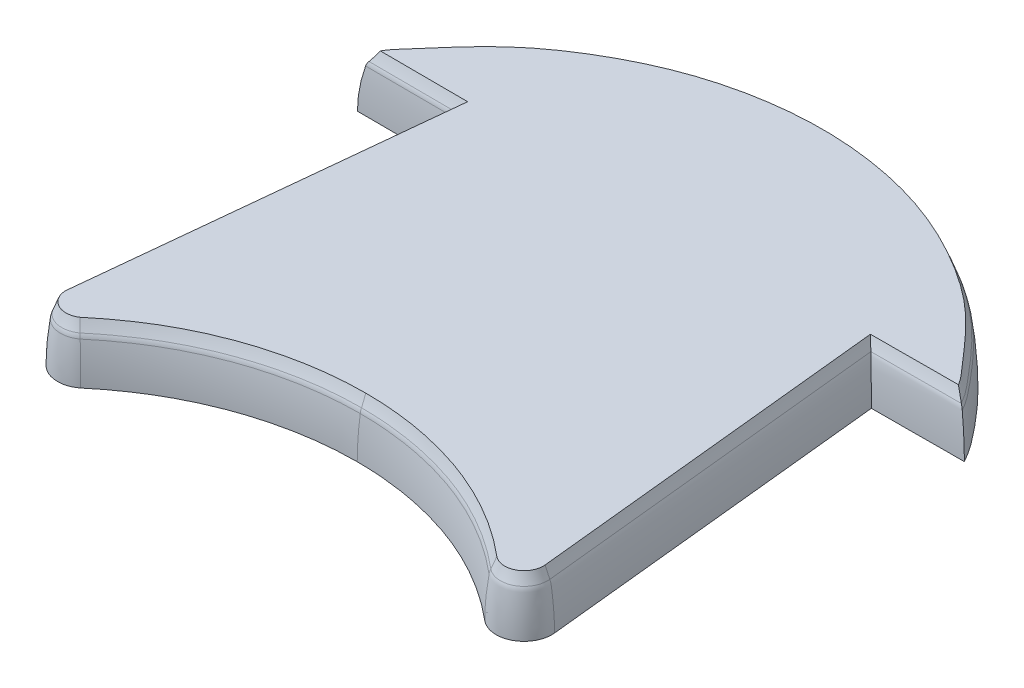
ISO-10303-21;
HEADER;
FILE_DESCRIPTION(('STEP AP214'),'2;1');
FILE_NAME('part.step','',(''),(''),'','','');
FILE_SCHEMA(('AUTOMOTIVE_DESIGN { 1 0 10303 214 1 1 1 1 }'));
ENDSEC;
DATA;
#1=APPLICATION_CONTEXT('core data for automotive mechanical design processes');
#2=APPLICATION_PROTOCOL_DEFINITION('international standard','automotive_design',2000,#1);
#3=PRODUCT_CONTEXT('',#1,'mechanical');
#4=PRODUCT('Part','Part','',(#3));
#5=PRODUCT_RELATED_PRODUCT_CATEGORY('part','',(#4));
#6=PRODUCT_DEFINITION_FORMATION('','',#4);
#7=PRODUCT_DEFINITION_CONTEXT('part definition',#1,'design');
#8=PRODUCT_DEFINITION('design','',#6,#7);
#9=PRODUCT_DEFINITION_SHAPE('','',#8);
#10=(LENGTH_UNIT() NAMED_UNIT(*) SI_UNIT(.MILLI.,.METRE.));
#11=(NAMED_UNIT(*) PLANE_ANGLE_UNIT() SI_UNIT($,.RADIAN.));
#12=(NAMED_UNIT(*) SI_UNIT($,.STERADIAN.) SOLID_ANGLE_UNIT());
#13=UNCERTAINTY_MEASURE_WITH_UNIT(LENGTH_MEASURE(1.E-05),#10,'distance_accuracy_value','');
#14=(GEOMETRIC_REPRESENTATION_CONTEXT(3) GLOBAL_UNCERTAINTY_ASSIGNED_CONTEXT((#13)) GLOBAL_UNIT_ASSIGNED_CONTEXT((#10,
#11,#12)) REPRESENTATION_CONTEXT('',''));
#15=CARTESIAN_POINT('',(0.,0.,0.));
#16=DIRECTION('',(0.,0.,1.));
#17=DIRECTION('',(1.,0.,0.));
#18=AXIS2_PLACEMENT_3D('',#15,#16,#17);
#19=CARTESIAN_POINT('',(38.3339144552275,19.0953627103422,42.3189963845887));
#20=DIRECTION('',(0.,-1.,0.));
#21=DIRECTION('',(0.,0.,-1.));
#22=AXIS2_PLACEMENT_3D('',#19,#20,#21);
#23=TOROIDAL_SURFACE('',#22,29.9133071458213,28.1694813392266);
#24=CARTESIAN_POINT('',(68.0912684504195,19.0953627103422,39.2684509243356));
#25=DIRECTION('',(0.101979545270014,1.00824891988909E-13,0.994786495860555));
#26=DIRECTION('',(0.994786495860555,0.,-0.101979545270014));
#27=AXIS2_PLACEMENT_3D('',#24,#25,#26);
#28=CIRCLE('',#27,28.1694813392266);
#29=CARTESIAN_POINT('',(41.690178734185,9.65199999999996,41.9749323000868));
#30=VERTEX_POINT('',#29);
#31=CARTESIAN_POINT('',(42.4234732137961,7.79225771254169,41.8997593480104));
#32=VERTEX_POINT('',#31);
#33=EDGE_CURVE('E289',#30,#32,#28,.T.);
#34=ORIENTED_EDGE('',*,*,#33,.F.);
#35=CARTESIAN_POINT('',(38.3339144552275,9.65199999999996,42.3189963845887));
#36=DIRECTION('',(0.,-1.,0.));
#37=DIRECTION('',(0.,0.,-1.));
#38=AXIS2_PLACEMENT_3D('',#35,#36,#37);
#39=CIRCLE('',#38,3.37385388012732);
#40=CARTESIAN_POINT('',(36.1545024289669,9.65199999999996,44.8944678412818));
#41=VERTEX_POINT('',#40);
#42=EDGE_CURVE('E285',#30,#41,#39,.T.);
#43=ORIENTED_EDGE('',*,*,#42,.T.);
#44=CARTESIAN_POINT('',(19.0107832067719,19.0953627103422,65.1536749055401));
#45=DIRECTION('',(-0.763361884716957,1.00824891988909E-13,-0.645971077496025));
#46=DIRECTION('',(-0.645971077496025,0.,0.763361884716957));
#47=AXIS2_PLACEMENT_3D('',#44,#45,#46);
#48=CIRCLE('',#47,28.1694813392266);
#49=CARTESIAN_POINT('',(35.6783328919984,7.79225771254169,45.4571705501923));
#50=VERTEX_POINT('',#49);
#51=EDGE_CURVE('E287',#41,#50,#48,.T.);
#52=ORIENTED_EDGE('',*,*,#51,.T.);
#53=CARTESIAN_POINT('',(38.3339144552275,7.79225771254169,42.3189963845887));
#54=DIRECTION('',(0.,-1.,0.));
#55=DIRECTION('',(0.,0.,-1.));
#56=AXIS2_PLACEMENT_3D('',#53,#54,#55);
#57=CIRCLE('',#56,4.11099142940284);
#58=EDGE_CURVE('E281',#32,#50,#57,.T.);
#59=ORIENTED_EDGE('',*,*,#58,.F.);
#60=EDGE_LOOP('',(#34,#43,#52,#59));
#61=FACE_BOUND('',#60,.T.);
#62=ADVANCED_FACE('F161',(#61),#23,.F.);
#63=CARTESIAN_POINT('',(42.4234732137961,7.79225771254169,41.8997593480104));
#64=CARTESIAN_POINT('',(42.5294760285,7.54901018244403,41.8888925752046));
#65=CARTESIAN_POINT('',(42.6029024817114,7.29391031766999,41.8813653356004));
#66=CARTESIAN_POINT('',(42.6424898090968,7.03134524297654,41.877307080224));
#67=CARTESIAN_POINT('',(42.9935283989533,4.703062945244,41.8413207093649));
#68=CARTESIAN_POINT('',(43.1698608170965,2.35487179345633,41.8232441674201));
#69=CARTESIAN_POINT('',(43.1704937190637,0.,41.8231792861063));
#70=(BOUNDED_CURVE() B_SPLINE_CURVE(3,(#63,#64,#65,#66,#67,#68,#69),.UNSPECIFIED.,.F.,
.F.) B_SPLINE_CURVE_WITH_KNOTS((4,3,4),(0.,0.0301460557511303,0.298501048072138),
.UNSPECIFIED.) CURVE() GEOMETRIC_REPRESENTATION_ITEM() RATIONAL_B_SPLINE_CURVE((1.,
0.99426744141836,0.99426744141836,1.,0.998122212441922,0.998122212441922,1.)) REPRESENTATION_ITEM(''));
#71=CARTESIAN_POINT('',(38.3339144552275,9.652,42.3189963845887));
#72=DIRECTION('',(0.,-1.,0.));
#73=AXIS1_PLACEMENT('',#71,#72);
#74=SURFACE_OF_REVOLUTION('',#70,#73);
#75=CARTESIAN_POINT('',(43.1704937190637,0.,41.8231792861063));
#76=VERTEX_POINT('',#75);
#77=EDGE_CURVE('E316',#32,#76,#70,.T.);
#78=ORIENTED_EDGE('',*,*,#77,.F.);
#79=ORIENTED_EDGE('',*,*,#58,.T.);
#80=CARTESIAN_POINT('',(35.6783328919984,7.79225771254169,45.4571705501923));
#81=CARTESIAN_POINT('',(35.6094992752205,7.54901018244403,45.538513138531));
#82=CARTESIAN_POINT('',(35.5618193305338,7.29391031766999,45.5948578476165));
#83=CARTESIAN_POINT('',(35.5361130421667,7.03134524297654,45.6252356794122));
#84=CARTESIAN_POINT('',(35.3081638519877,4.703062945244,45.8946095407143));
#85=CARTESIAN_POINT('',(35.1936612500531,2.35487179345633,46.0299204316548));
#86=CARTESIAN_POINT('',(35.1932502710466,0.,46.0304060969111));
#87=(BOUNDED_CURVE() B_SPLINE_CURVE(3,(#80,#81,#82,#83,#84,#85,#86),.UNSPECIFIED.,.F.,
.F.) B_SPLINE_CURVE_WITH_KNOTS((4,3,4),(0.,0.0301460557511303,0.298501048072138),
.UNSPECIFIED.) CURVE() GEOMETRIC_REPRESENTATION_ITEM() RATIONAL_B_SPLINE_CURVE((1.,
0.99426744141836,0.99426744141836,1.,0.998122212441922,0.998122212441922,1.)) REPRESENTATION_ITEM(''));
#88=CARTESIAN_POINT('',(35.5361130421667,7.03134524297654,45.6252356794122));
#89=VERTEX_POINT('',#88);
#90=EDGE_CURVE('E567',#50,#89,#87,.T.);
#91=ORIENTED_EDGE('',*,*,#90,.T.);
#92=CARTESIAN_POINT('',(35.6783328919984,7.79225771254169,45.4571705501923));
#93=CARTESIAN_POINT('',(35.6094992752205,7.54901018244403,45.538513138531));
#94=CARTESIAN_POINT('',(35.5618193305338,7.29391031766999,45.5948578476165));
#95=CARTESIAN_POINT('',(35.5361130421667,7.03134524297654,45.6252356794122));
#96=CARTESIAN_POINT('',(35.3081638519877,4.703062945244,45.8946095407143));
#97=CARTESIAN_POINT('',(35.1936612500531,2.35487179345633,46.0299204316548));
#98=CARTESIAN_POINT('',(35.1932502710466,0.,46.0304060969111));
#99=(BOUNDED_CURVE() B_SPLINE_CURVE(3,(#92,#93,#94,#95,#96,#97,#98),.UNSPECIFIED.,.F.,
.F.) B_SPLINE_CURVE_WITH_KNOTS((4,3,4),(0.,0.0301460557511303,0.298501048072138),
.UNSPECIFIED.) CURVE() GEOMETRIC_REPRESENTATION_ITEM() RATIONAL_B_SPLINE_CURVE((1.,
0.99426744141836,0.99426744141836,1.,0.998122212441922,0.998122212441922,1.)) REPRESENTATION_ITEM(''));
#100=CARTESIAN_POINT('',(35.1932502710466,0.,46.0304060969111));
#101=VERTEX_POINT('',#100);
#102=EDGE_CURVE('E455',#89,#101,#99,.T.);
#103=ORIENTED_EDGE('',*,*,#102,.T.);
#104=CARTESIAN_POINT('',(38.3339144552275,0.,42.3189963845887));
#105=DIRECTION('',(0.,-1.,0.));
#106=DIRECTION('',(0.,0.,-1.));
#107=AXIS2_PLACEMENT_3D('',#104,#105,#106);
#108=CIRCLE('',#107,4.86192694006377);
#109=EDGE_CURVE('E330',#76,#101,#108,.T.);
#110=ORIENTED_EDGE('',*,*,#109,.F.);
#111=EDGE_LOOP('',(#78,#79,#91,#103,#110));
#112=FACE_BOUND('',#111,.T.);
#113=ADVANCED_FACE('F599',(#112),#74,.T.);
#114=CARTESIAN_POINT('',(-32.943821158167,6.57779905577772,-23.3869402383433));
#115=DIRECTION('',(-0.999992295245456,0.,-0.00392548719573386));
#116=DIRECTION('',(-0.00392548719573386,0.,0.999992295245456));
#117=AXIS2_PLACEMENT_3D('',#114,#115,#116);
#118=CYLINDRICAL_SURFACE('',#117,3.02666130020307);
#119=CARTESIAN_POINT('',(-47.0704733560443,6.57779905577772,-23.4423946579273));
#120=DIRECTION('',(-0.505778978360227,0.,-0.862663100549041));
#121=DIRECTION('',(-0.862663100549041,0.,0.505778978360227));
#122=AXIS2_PLACEMENT_3D('',#119,#120,#121);
#123=ELLIPSE('',#122,5.9444038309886,3.02666130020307);
#124=CARTESIAN_POINT('',(-51.7675685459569,7.79225771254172,-20.6884899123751));
#125=VERTEX_POINT('',#124);
#126=CARTESIAN_POINT('',(-52.1405891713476,7.03134524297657,-20.4697880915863));
#127=VERTEX_POINT('',#126);
#128=EDGE_CURVE('E451',#125,#127,#123,.F.);
#129=ORIENTED_EDGE('',*,*,#128,.T.);
#130=DIRECTION('',(-0.999992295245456,0.,-0.00392548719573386));
#131=VECTOR('',#130,1.);
#132=CARTESIAN_POINT('',(-36.2574312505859,7.03134524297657,-20.4074384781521));
#133=LINE('',#132,#131);
#134=CARTESIAN_POINT('',(-36.2574312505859,7.03134524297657,-20.4074384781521));
#135=VERTEX_POINT('',#134);
#136=EDGE_CURVE('E459',#135,#127,#133,.T.);
#137=ORIENTED_EDGE('',*,*,#136,.F.);
#138=CARTESIAN_POINT('',(-32.943821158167,6.57779905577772,-23.3869402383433));
#139=DIRECTION('',(-0.668624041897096,0.,-0.743600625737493));
#140=DIRECTION('',(0.743600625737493,0.,-0.668624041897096));
#141=AXIS2_PLACEMENT_3D('',#138,#139,#140);
#142=ELLIPSE('',#141,4.50705964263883,3.02666130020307);
#143=CARTESIAN_POINT('',(-36.0136409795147,7.79225771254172,-20.6266475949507));
#144=VERTEX_POINT('',#143);
#145=EDGE_CURVE('E454',#135,#144,#142,.T.);
#146=ORIENTED_EDGE('',*,*,#145,.T.);
#147=DIRECTION('',(-0.999992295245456,0.,-0.00392548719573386));
#148=VECTOR('',#147,1.);
#149=CARTESIAN_POINT('',(-36.0136409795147,7.79225771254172,-20.6266475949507));
#150=LINE('',#149,#148);
#151=EDGE_CURVE('E450',#144,#125,#150,.T.);
#152=ORIENTED_EDGE('',*,*,#151,.T.);
#153=EDGE_LOOP('',(#129,#137,#146,#152));
#154=FACE_BOUND('',#153,.T.);
#155=ADVANCED_FACE('F636',(#154),#118,.T.);
#156=CARTESIAN_POINT('',(-64.5848035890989,19.0953627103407,5.06371032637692));
#157=DIRECTION('',(-0.999992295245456,0.,-0.00392548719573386));
#158=DIRECTION('',(-0.00392548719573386,0.,0.999992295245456));
#159=AXIS2_PLACEMENT_3D('',#156,#157,#158);
#160=CYLINDRICAL_SURFACE('',#159,28.1694813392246);
#161=CARTESIAN_POINT('',(-95.4839682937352,19.0953627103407,4.94241511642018));
#162=DIRECTION('',(-0.505778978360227,0.,-0.862663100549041));
#163=DIRECTION('',(-0.862663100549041,0.,0.505778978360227));
#164=AXIS2_PLACEMENT_3D('',#161,#162,#163);
#165=ELLIPSE('',#164,55.3252432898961,28.1694813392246);
#166=CARTESIAN_POINT('',(-50.5186496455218,9.65199999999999,-21.4207304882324));
#167=VERTEX_POINT('',#166);
#168=EDGE_CURVE('E443',#167,#125,#165,.T.);
#169=ORIENTED_EDGE('',*,*,#168,.T.);
#170=ORIENTED_EDGE('',*,*,#151,.F.);
#171=CARTESIAN_POINT('',(-64.5848035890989,19.0953627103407,5.06371032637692));
#172=DIRECTION('',(-0.668624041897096,0.,-0.743600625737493));
#173=DIRECTION('',(0.743600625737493,0.,-0.668624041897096));
#174=AXIS2_PLACEMENT_3D('',#171,#172,#173);
#175=ELLIPSE('',#174,41.9477172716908,28.1694813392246);
#176=CARTESIAN_POINT('',(-35.1974011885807,9.65199999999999,-21.3605866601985));
#177=VERTEX_POINT('',#176);
#178=EDGE_CURVE('E449',#144,#177,#175,.F.);
#179=ORIENTED_EDGE('',*,*,#178,.T.);
#180=DIRECTION('',(-0.999992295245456,0.,-0.00392548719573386));
#181=VECTOR('',#180,1.);
#182=CARTESIAN_POINT('',(-35.1974011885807,9.65199999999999,-21.3605866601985));
#183=LINE('',#182,#181);
#184=EDGE_CURVE('E463',#177,#167,#183,.T.);
#185=ORIENTED_EDGE('',*,*,#184,.T.);
#186=EDGE_LOOP('',(#169,#170,#179,#185));
#187=FACE_BOUND('',#186,.T.);
#188=ADVANCED_FACE('F627',(#187),#160,.F.);
#189=CARTESIAN_POINT('',(15.2063889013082,-0.012700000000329,-66.6822078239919));
#190=DIRECTION('',(-0.999992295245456,0.,-0.00392548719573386));
#191=DIRECTION('',(-0.00392548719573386,0.,0.999992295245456));
#192=AXIS2_PLACEMENT_3D('',#189,#190,#191);
#193=CYLINDRICAL_SURFACE('',#192,47.0072061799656);
#194=CARTESIAN_POINT('',(26.6035965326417,-0.012700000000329,-66.6374678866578));
#195=DIRECTION('',(-0.505778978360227,0.,-0.862663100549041));
#196=DIRECTION('',(-0.862663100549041,0.,0.505778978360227));
#197=AXIS2_PLACEMENT_3D('',#194,#195,#196);
#198=ELLIPSE('',#197,92.3227902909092,47.0072061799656);
#199=CARTESIAN_POINT('',(-53.0398650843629,0.,-19.9425430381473));
#200=VERTEX_POINT('',#199);
#201=EDGE_CURVE('E460',#127,#200,#198,.F.);
#202=ORIENTED_EDGE('',*,*,#201,.T.);
#203=DIRECTION('',(-0.999992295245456,0.,-0.00392548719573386));
#204=VECTOR('',#203,1.);
#205=CARTESIAN_POINT('',(-36.8451593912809,0.,-19.8789704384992));
#206=LINE('',#205,#204);
#207=CARTESIAN_POINT('',(-36.8451593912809,0.,-19.8789704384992));
#208=VERTEX_POINT('',#207);
#209=EDGE_CURVE('E308',#208,#200,#206,.T.);
#210=ORIENTED_EDGE('',*,*,#209,.F.);
#211=CARTESIAN_POINT('',(15.2063889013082,-0.012700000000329,-66.6822078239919));
#212=DIRECTION('',(-0.668624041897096,0.,-0.743600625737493));
#213=DIRECTION('',(0.743600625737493,0.,-0.668624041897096));
#214=AXIS2_PLACEMENT_3D('',#211,#212,#213);
#215=ELLIPSE('',#214,69.9993361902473,47.0072061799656);
#216=EDGE_CURVE('E456',#208,#135,#215,.T.);
#217=ORIENTED_EDGE('',*,*,#216,.T.);
#218=ORIENTED_EDGE('',*,*,#136,.T.);
#219=EDGE_LOOP('',(#202,#210,#217,#218));
#220=FACE_BOUND('',#219,.T.);
#221=ADVANCED_FACE('F639',(#220),#193,.T.);
#222=CARTESIAN_POINT('',(-68.0496904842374,19.0953627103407,38.8628676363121));
#223=DIRECTION('',(0.101979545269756,0.,-0.994786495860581));
#224=DIRECTION('',(-0.994786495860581,0.,-0.101979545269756));
#225=AXIS2_PLACEMENT_3D('',#222,#223,#224);
#226=CYLINDRICAL_SURFACE('',#225,28.1694813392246);
#227=DIRECTION('',(0.101979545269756,0.,-0.994786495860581));
#228=VECTOR('',#227,1.);
#229=CARTESIAN_POINT('',(-42.392193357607,7.79225771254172,41.5946317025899));
#230=LINE('',#229,#228);
#231=CARTESIAN_POINT('',(-42.392193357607,7.79225771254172,41.5946317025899));
#232=VERTEX_POINT('',#231);
#233=EDGE_CURVE('E540',#232,#144,#230,.T.);
#234=ORIENTED_EDGE('',*,*,#233,.F.);
#235=CARTESIAN_POINT('',(-41.6486007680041,9.65199999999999,41.5693490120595));
#236=CARTESIAN_POINT('',(-41.874198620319,9.02348775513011,41.5770195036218));
#237=CARTESIAN_POINT('',(-42.1221670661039,8.40331292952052,41.5854506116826));
#238=CARTESIAN_POINT('',(-42.392193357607,7.79225771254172,41.5946317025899));
#239=(BOUNDED_CURVE() B_SPLINE_CURVE(3,(#235,#236,#237,#238),.UNSPECIFIED.,.F.,
.F.) B_SPLINE_CURVE_WITH_KNOTS((4,4),(0.,0.0834927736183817),
.UNSPECIFIED.) CURVE() GEOMETRIC_REPRESENTATION_ITEM() RATIONAL_B_SPLINE_CURVE((1.,
0.999579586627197,0.999579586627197,1.)) REPRESENTATION_ITEM(''));
#240=CARTESIAN_POINT('',(-41.6486007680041,9.65199999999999,41.5693490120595));
#241=VERTEX_POINT('',#240);
#242=EDGE_CURVE('E502',#241,#232,#239,.T.);
#243=ORIENTED_EDGE('',*,*,#242,.F.);
#244=DIRECTION('',(0.101979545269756,0.,-0.994786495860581));
#245=VECTOR('',#244,1.);
#246=CARTESIAN_POINT('',(-41.6486007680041,9.65199999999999,41.5693490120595));
#247=LINE('',#246,#245);
#248=EDGE_CURVE('E541',#241,#177,#247,.T.);
#249=ORIENTED_EDGE('',*,*,#248,.T.);
#250=ORIENTED_EDGE('',*,*,#178,.F.);
#251=EDGE_LOOP('',(#234,#243,#249,#250));
#252=FACE_BOUND('',#251,.T.);
#253=ADVANCED_FACE('F630',(#252),#226,.F.);
#254=CARTESIAN_POINT('',(3.61984256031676,-0.012700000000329,46.3418285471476));
#255=DIRECTION('',(0.101979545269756,0.,-0.994786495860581));
#256=DIRECTION('',(-0.994786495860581,0.,-0.101979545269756));
#257=AXIS2_PLACEMENT_3D('',#254,#255,#256);
#258=CYLINDRICAL_SURFACE('',#257,47.0072061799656);
#259=DIRECTION('',(0.101979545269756,0.,-0.994786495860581));
#260=VECTOR('',#259,1.);
#261=CARTESIAN_POINT('',(-43.1497047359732,0.,41.6203876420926));
#262=LINE('',#261,#260);
#263=CARTESIAN_POINT('',(-43.1497047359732,0.,41.6203876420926));
#264=VERTEX_POINT('',#263);
#265=EDGE_CURVE('E13',#264,#208,#262,.T.);
#266=ORIENTED_EDGE('',*,*,#265,.F.);
#267=CARTESIAN_POINT('',(-42.6142857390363,7.03134524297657,41.6021830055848));
#268=CARTESIAN_POINT('',(-42.9702541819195,4.70306294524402,41.6142861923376));
#269=CARTESIAN_POINT('',(-43.1490629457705,2.35487179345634,41.6203658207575));
#270=CARTESIAN_POINT('',(-43.1497047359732,0.,41.6203876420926));
#271=(BOUNDED_CURVE() B_SPLINE_CURVE(3,(#267,#268,#269,#270),.UNSPECIFIED.,.F.,
.F.) B_SPLINE_CURVE_WITH_KNOTS((4,4),(0.116552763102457,0.410847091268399),
.UNSPECIFIED.) CURVE() GEOMETRIC_REPRESENTATION_ITEM() RATIONAL_B_SPLINE_CURVE((1.,
0.998122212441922,0.998122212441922,1.)) REPRESENTATION_ITEM(''));
#272=CARTESIAN_POINT('',(-42.6142857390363,7.03134524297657,41.6021830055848));
#273=VERTEX_POINT('',#272);
#274=EDGE_CURVE('E511',#273,#264,#271,.T.);
#275=ORIENTED_EDGE('',*,*,#274,.F.);
#276=DIRECTION('',(0.101979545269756,0.,-0.994786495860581));
#277=VECTOR('',#276,1.);
#278=CARTESIAN_POINT('',(-42.6142857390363,7.03134524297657,41.6021830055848));
#279=LINE('',#278,#277);
#280=EDGE_CURVE('E542',#273,#135,#279,.T.);
#281=ORIENTED_EDGE('',*,*,#280,.T.);
#282=ORIENTED_EDGE('',*,*,#216,.F.);
#283=EDGE_LOOP('',(#266,#275,#281,#282));
#284=FACE_BOUND('',#283,.T.);
#285=ADVANCED_FACE('F648',(#284),#258,.T.);
#286=CARTESIAN_POINT('',(-39.6343249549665,6.57779905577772,41.8773518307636));
#287=DIRECTION('',(0.101979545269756,0.,-0.994786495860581));
#288=DIRECTION('',(-0.994786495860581,0.,-0.101979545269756));
#289=AXIS2_PLACEMENT_3D('',#286,#287,#288);
#290=CYLINDRICAL_SURFACE('',#289,3.02666130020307);
#291=ORIENTED_EDGE('',*,*,#280,.F.);
#292=CARTESIAN_POINT('',(-42.392193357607,7.79225771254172,41.5946317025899));
#293=CARTESIAN_POINT('',(-42.4996848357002,7.54901018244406,41.5982864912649));
#294=CARTESIAN_POINT('',(-42.5741424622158,7.29391031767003,41.6008181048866));
#295=CARTESIAN_POINT('',(-42.6142857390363,7.03134524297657,41.6021830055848));
#296=(BOUNDED_CURVE() B_SPLINE_CURVE(3,(#292,#293,#294,#295),.UNSPECIFIED.,.F.,
.F.) B_SPLINE_CURVE_WITH_KNOTS((4,4),(0.0834927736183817,0.116552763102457),
.UNSPECIFIED.) CURVE() GEOMETRIC_REPRESENTATION_ITEM() RATIONAL_B_SPLINE_CURVE((1.,
0.994267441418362,0.994267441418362,1.)) REPRESENTATION_ITEM(''));
#297=EDGE_CURVE('E520',#232,#273,#296,.T.);
#298=ORIENTED_EDGE('',*,*,#297,.F.);
#299=ORIENTED_EDGE('',*,*,#233,.T.);
#300=ORIENTED_EDGE('',*,*,#145,.F.);
#301=EDGE_LOOP('',(#291,#298,#299,#300));
#302=FACE_BOUND('',#301,.T.);
#303=ADVANCED_FACE('F634',(#302),#290,.T.);
#304=CARTESIAN_POINT('',(-35.9124764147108,7.79225771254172,45.6553071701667));
#305=CARTESIAN_POINT('',(-35.8324994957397,7.54901018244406,45.7272200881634));
#306=CARTESIAN_POINT('',(-35.777100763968,7.29391031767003,45.7770330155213));
#307=CARTESIAN_POINT('',(-35.7472329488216,7.03134524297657,45.8038892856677));
#308=(BOUNDED_CURVE() B_SPLINE_CURVE(3,(#304,#305,#306,#307),.UNSPECIFIED.,.F.,
.F.) B_SPLINE_CURVE_WITH_KNOTS((4,4),(0.0834927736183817,0.116552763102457),
.UNSPECIFIED.) CURVE() GEOMETRIC_REPRESENTATION_ITEM() RATIONAL_B_SPLINE_CURVE((1.,
0.994267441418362,0.994267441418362,1.)) REPRESENTATION_ITEM(''));
#309=CARTESIAN_POINT('',(-38.3339144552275,9.652,42.3189963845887));
#310=DIRECTION('',(0.,-1.,0.));
#311=AXIS1_PLACEMENT('',#309,#310);
#312=SURFACE_OF_REVOLUTION('',#308,#311);
#313=CARTESIAN_POINT('',(-35.9124764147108,7.79225771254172,45.6553071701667));
#314=VERTEX_POINT('',#313);
#315=CARTESIAN_POINT('',(-35.7472329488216,7.03134524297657,45.8038892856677));
#316=VERTEX_POINT('',#315);
#317=EDGE_CURVE('E470',#314,#316,#308,.T.);
#318=ORIENTED_EDGE('',*,*,#317,.F.);
#319=CARTESIAN_POINT('',(-38.3339144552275,7.79225771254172,42.3189963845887));
#320=DIRECTION('',(0.,-1.,0.));
#321=DIRECTION('',(0.,0.,-1.));
#322=AXIS2_PLACEMENT_3D('',#319,#320,#321);
#323=CIRCLE('',#322,4.12241820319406);
#324=EDGE_CURVE('E528',#314,#232,#323,.T.);
#325=ORIENTED_EDGE('',*,*,#324,.T.);
#326=ORIENTED_EDGE('',*,*,#297,.T.);
#327=CARTESIAN_POINT('',(-38.3339144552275,7.03134524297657,42.3189963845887));
#328=DIRECTION('',(0.,-1.,0.));
#329=DIRECTION('',(0.,0.,-1.));
#330=AXIS2_PLACEMENT_3D('',#327,#328,#329);
#331=CIRCLE('',#330,4.33997692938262);
#332=EDGE_CURVE('E519',#316,#273,#331,.T.);
#333=ORIENTED_EDGE('',*,*,#332,.F.);
#334=EDGE_LOOP('',(#318,#325,#326,#333));
#335=FACE_BOUND('',#334,.T.);
#336=ADVANCED_FACE('F484',(#335),#312,.T.);
#337=CARTESIAN_POINT('',(-35.7472329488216,7.03134524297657,45.8038892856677));
#338=CARTESIAN_POINT('',(-35.4823816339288,4.70306294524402,46.042035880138));
#339=CARTESIAN_POINT('',(-35.3493424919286,2.35487179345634,46.1616608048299));
#340=CARTESIAN_POINT('',(-35.3488649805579,0.,46.1620901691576));
#341=(BOUNDED_CURVE() B_SPLINE_CURVE(3,(#337,#338,#339,#340),.UNSPECIFIED.,.F.,
.F.) B_SPLINE_CURVE_WITH_KNOTS((4,4),(0.116552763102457,0.410847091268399),
.UNSPECIFIED.) CURVE() GEOMETRIC_REPRESENTATION_ITEM() RATIONAL_B_SPLINE_CURVE((1.,
0.998122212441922,0.998122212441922,1.)) REPRESENTATION_ITEM(''));
#342=CARTESIAN_POINT('',(-38.3339144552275,9.652,42.3189963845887));
#343=DIRECTION('',(0.,-1.,0.));
#344=AXIS1_PLACEMENT('',#342,#343);
#345=SURFACE_OF_REVOLUTION('',#341,#344);
#346=CARTESIAN_POINT('',(-35.3488649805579,0.,46.1620901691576));
#347=VERTEX_POINT('',#346);
#348=EDGE_CURVE('E442',#316,#347,#341,.T.);
#349=ORIENTED_EDGE('',*,*,#348,.F.);
#350=ORIENTED_EDGE('',*,*,#332,.T.);
#351=ORIENTED_EDGE('',*,*,#274,.T.);
#352=CARTESIAN_POINT('',(-38.3339144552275,0.,42.3189963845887));
#353=DIRECTION('',(0.,-1.,0.));
#354=DIRECTION('',(0.,0.,-1.));
#355=AXIS2_PLACEMENT_3D('',#352,#353,#354);
#356=CIRCLE('',#355,4.86619874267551);
#357=EDGE_CURVE('E175',#347,#264,#356,.T.);
#358=ORIENTED_EDGE('',*,*,#357,.F.);
#359=EDGE_LOOP('',(#349,#350,#351,#358));
#360=FACE_BOUND('',#359,.T.);
#361=ADVANCED_FACE('F479',(#360),#345,.T.);
#362=CARTESIAN_POINT('',(-36.4657318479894,9.65199999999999,45.1578359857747));
#363=CARTESIAN_POINT('',(-36.2978802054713,9.02348775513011,45.3087632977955));
#364=CARTESIAN_POINT('',(-36.1133841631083,8.40331292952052,45.4746567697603));
#365=CARTESIAN_POINT('',(-35.9124764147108,7.79225771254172,45.6553071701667));
#366=(BOUNDED_CURVE() B_SPLINE_CURVE(3,(#362,#363,#364,#365),.UNSPECIFIED.,.F.,
.F.) B_SPLINE_CURVE_WITH_KNOTS((4,4),(0.,0.0834927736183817),
.UNSPECIFIED.) CURVE() GEOMETRIC_REPRESENTATION_ITEM() RATIONAL_B_SPLINE_CURVE((1.,
0.999579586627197,0.999579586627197,1.)) REPRESENTATION_ITEM(''));
#367=CARTESIAN_POINT('',(-38.3339144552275,9.652,42.3189963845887));
#368=DIRECTION('',(0.,-1.,0.));
#369=AXIS1_PLACEMENT('',#367,#368);
#370=SURFACE_OF_REVOLUTION('',#366,#369);
#371=CARTESIAN_POINT('',(-36.4657318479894,9.65199999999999,45.1578359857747));
#372=VERTEX_POINT('',#371);
#373=EDGE_CURVE('E495',#372,#314,#366,.T.);
#374=ORIENTED_EDGE('',*,*,#373,.F.);
#375=CARTESIAN_POINT('',(-38.3339144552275,9.65199999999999,42.3189963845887));
#376=DIRECTION('',(0.,-1.,0.));
#377=DIRECTION('',(0.,0.,-1.));
#378=AXIS2_PLACEMENT_3D('',#375,#376,#377);
#379=CIRCLE('',#378,3.39839911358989);
#380=EDGE_CURVE('E510',#372,#241,#379,.T.);
#381=ORIENTED_EDGE('',*,*,#380,.T.);
#382=ORIENTED_EDGE('',*,*,#242,.T.);
#383=ORIENTED_EDGE('',*,*,#324,.F.);
#384=EDGE_LOOP('',(#374,#381,#382,#383));
#385=FACE_BOUND('',#384,.T.);
#386=ADVANCED_FACE('F483',(#385),#370,.T.);
#387=CARTESIAN_POINT('',(0.,9.652,31.6500152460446));
#388=CARTESIAN_POINT('',(-3.59582299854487,9.652,31.6500152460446));
#389=CARTESIAN_POINT('',(-10.1113905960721,9.65199999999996,32.2780280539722));
#390=CARTESIAN_POINT('',(-16.5332461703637,9.65199999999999,34.0768226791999));
#391=CARTESIAN_POINT('',(-20.0073938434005,9.65200000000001,35.3457549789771));
#392=CARTESIAN_POINT('',(-23.4467712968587,9.65200000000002,36.6854952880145));
#393=CARTESIAN_POINT('',(-29.2465231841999,9.65200000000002,39.6263962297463));
#394=CARTESIAN_POINT('',(-34.2053615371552,9.65199999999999,43.2450684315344));
#395=CARTESIAN_POINT('',(-36.4657318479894,9.65199999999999,45.1578359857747));
#396=CARTESIAN_POINT('',(0.,9.02348775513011,31.873654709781));
#397=CARTESIAN_POINT('',(-3.57904607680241,9.02348775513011,31.873654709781));
#398=CARTESIAN_POINT('',(-10.0724824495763,9.02348775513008,32.499736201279));
#399=CARTESIAN_POINT('',(-16.4665195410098,9.0234877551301,34.289972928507));
#400=CARTESIAN_POINT('',(-19.9269388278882,9.02348775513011,35.554192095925));
#401=CARTESIAN_POINT('',(-23.3530924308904,9.02348775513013,36.8892408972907));
#402=CARTESIAN_POINT('',(-29.1354500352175,9.02348775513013,39.8230055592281));
#403=CARTESIAN_POINT('',(-34.0565740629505,9.02348775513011,43.4121281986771));
#404=CARTESIAN_POINT('',(-36.2978802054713,9.02348775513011,45.3087632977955));
#405=CARTESIAN_POINT('',(0.,8.40331292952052,32.1194705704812));
#406=CARTESIAN_POINT('',(-3.56226915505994,8.40331292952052,32.1194705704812));
#407=CARTESIAN_POINT('',(-10.0292842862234,8.40331292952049,32.743501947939));
#408=CARTESIAN_POINT('',(-16.3928277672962,8.40331292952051,34.5241451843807));
#409=CARTESIAN_POINT('',(-19.8383832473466,8.40331292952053,35.7832414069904));
#410=CARTESIAN_POINT('',(-23.2502764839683,8.40331292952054,37.1132352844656));
#411=CARTESIAN_POINT('',(-29.0141912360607,8.40331292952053,40.0398468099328));
#412=CARTESIAN_POINT('',(-33.8911421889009,8.40331292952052,43.5941541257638));
#413=CARTESIAN_POINT('',(-36.1133841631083,8.40331292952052,45.4746567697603));
#414=CARTESIAN_POINT('',(0.,7.79225771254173,32.3871527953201));
#415=CARTESIAN_POINT('',(-3.54796981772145,7.79225771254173,32.3871527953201));
#416=CARTESIAN_POINT('',(-9.98121298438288,7.79225771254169,33.0091252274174));
#417=CARTESIAN_POINT('',(-16.3117492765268,7.79225771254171,34.7788753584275));
#418=CARTESIAN_POINT('',(-19.7416578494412,7.79225771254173,36.0325302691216));
#419=CARTESIAN_POINT('',(-23.1386779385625,7.79225771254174,37.3572625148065));
#420=CARTESIAN_POINT('',(-28.8841232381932,7.79225771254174,40.2777331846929));
#421=CARTESIAN_POINT('',(-33.7064828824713,7.79225771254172,43.7885542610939));
#422=CARTESIAN_POINT('',(-35.9124764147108,7.79225771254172,45.6553071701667));
#423=(BOUNDED_SURFACE() B_SPLINE_SURFACE(3,3,((#387,#388,#389,#390,#391,#392,#393,#394,#395),
(#396,#397,#398,#399,#400,#401,#402,#403,#404),(#405,#406,#407,#408,#409,#410,#411,#412,#413),
(#414,#415,#416,#417,#418,#419,#420,#421,#422)),.UNSPECIFIED.,.F.,.F.,
.F.) B_SPLINE_SURFACE_WITH_KNOTS((4,4),(4,1,2,1,1,4),(0.,0.0834927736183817),(0.,
0.280000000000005,0.5,0.56,0.78,1.),
.UNSPECIFIED.) GEOMETRIC_REPRESENTATION_ITEM() RATIONAL_B_SPLINE_SURFACE(((1.,1.,1.,1.,1.,1.,1.,
1.,1.),(0.999579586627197,0.999579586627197,0.999579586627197,0.999579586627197,
0.999579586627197,0.999579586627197,0.999579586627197,0.999579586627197,0.999579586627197),
(0.999579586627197,0.999579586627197,0.999579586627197,0.999579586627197,0.999579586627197,
0.999579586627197,0.999579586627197,0.999579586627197,0.999579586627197),(1.,1.,1.,1.,1.,1.,1.,
1.,1.))) REPRESENTATION_ITEM('') SURFACE());
#424=CARTESIAN_POINT('',(0.,19.0953627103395,58.1894685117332));
#425=DIRECTION('',(-1.,0.,0.));
#426=DIRECTION('',(0.,0.,1.));
#427=AXIS2_PLACEMENT_3D('',#424,#425,#426);
#428=CIRCLE('',#427,28.1694813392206);
#429=CARTESIAN_POINT('',(0.,9.65199999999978,31.6500152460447));
#430=VERTEX_POINT('',#429);
#431=CARTESIAN_POINT('',(0.,7.79225771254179,32.3871527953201));
#432=VERTEX_POINT('',#431);
#433=EDGE_CURVE('E306',#430,#432,#428,.T.);
#434=CARTESIAN_POINT('',(0.,9.652,31.6500152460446));
#435=CARTESIAN_POINT('',(-3.59582299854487,9.652,31.6500152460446));
#436=CARTESIAN_POINT('',(-10.1113905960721,9.65199999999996,32.2780280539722));
#437=CARTESIAN_POINT('',(-16.5332461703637,9.65199999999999,34.0768226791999));
#438=CARTESIAN_POINT('',(-20.0073938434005,9.65200000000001,35.3457549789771));
#439=CARTESIAN_POINT('',(-23.4467712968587,9.65200000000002,36.6854952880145));
#440=CARTESIAN_POINT('',(-29.2465231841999,9.65200000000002,39.6263962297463));
#441=CARTESIAN_POINT('',(-34.2053615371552,9.65199999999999,43.2450684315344));
#442=CARTESIAN_POINT('',(-36.4657318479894,9.65199999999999,45.1578359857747));
#443=B_SPLINE_CURVE_WITH_KNOTS('',3,(#434,#435,#436,#437,#438,#439,#440,#441,#442),
.UNSPECIFIED.,.F.,.F.,(4,1,2,1,1,4),(0.,0.280000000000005,0.5,0.56,0.78,1.),.UNSPECIFIED.);
#444=EDGE_CURVE('E305',#430,#372,#443,.T.);
#445=CARTESIAN_POINT('',(0.,7.79225771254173,32.3871527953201));
#446=CARTESIAN_POINT('',(-3.54796981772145,7.79225771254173,32.3871527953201));
#447=CARTESIAN_POINT('',(-9.98121298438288,7.79225771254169,33.0091252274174));
#448=CARTESIAN_POINT('',(-16.3117492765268,7.79225771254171,34.7788753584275));
#449=CARTESIAN_POINT('',(-19.7416578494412,7.79225771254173,36.0325302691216));
#450=CARTESIAN_POINT('',(-23.1386779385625,7.79225771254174,37.3572625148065));
#451=CARTESIAN_POINT('',(-28.8841232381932,7.79225771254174,40.2777331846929));
#452=CARTESIAN_POINT('',(-33.7064828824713,7.79225771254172,43.7885542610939));
#453=CARTESIAN_POINT('',(-35.9124764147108,7.79225771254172,45.6553071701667));
#454=B_SPLINE_CURVE_WITH_KNOTS('',3,(#445,#446,#447,#448,#449,#450,#451,#452,#453),
.UNSPECIFIED.,.F.,.F.,(4,1,2,1,1,4),(0.,0.280000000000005,0.5,0.56,0.78,1.),.UNSPECIFIED.);
#455=EDGE_CURVE('E501',#432,#314,#454,.T.);
#456=ORIENTED_EDGE('',*,*,#433,.F.);
#457=ORIENTED_EDGE('',*,*,#444,.T.);
#458=ORIENTED_EDGE('',*,*,#373,.T.);
#459=ORIENTED_EDGE('',*,*,#455,.F.);
#460=EDGE_LOOP('',(#456,#457,#458,#459));
#461=FACE_BOUND('',#460,.T.);
#462=ADVANCED_FACE('F489',(#461),#423,.F.);
#463=CARTESIAN_POINT('',(0.,7.79225771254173,32.3871527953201));
#464=CARTESIAN_POINT('',(-3.54796981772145,7.79225771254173,32.3871527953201));
#465=CARTESIAN_POINT('',(-9.98121298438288,7.79225771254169,33.0091252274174));
#466=CARTESIAN_POINT('',(-16.3117492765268,7.79225771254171,34.7788753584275));
#467=CARTESIAN_POINT('',(-19.7416578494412,7.79225771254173,36.0325302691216));
#468=CARTESIAN_POINT('',(-23.1386779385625,7.79225771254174,37.3572625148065));
#469=CARTESIAN_POINT('',(-28.8841232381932,7.79225771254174,40.2777331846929));
#470=CARTESIAN_POINT('',(-33.7064828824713,7.79225771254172,43.7885542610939));
#471=CARTESIAN_POINT('',(-35.9124764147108,7.79225771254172,45.6553071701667));
#472=CARTESIAN_POINT('',(0.,7.54901018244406,32.4937111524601));
#473=CARTESIAN_POINT('',(-3.54230781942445,7.54901018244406,32.4937111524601));
#474=CARTESIAN_POINT('',(-9.96206901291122,7.54901018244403,33.114865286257));
#475=CARTESIAN_POINT('',(-16.27946739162,7.54901018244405,34.8802757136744));
#476=CARTESIAN_POINT('',(-19.7031513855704,7.54901018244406,36.1317656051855));
#477=CARTESIAN_POINT('',(-23.0942558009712,7.54901018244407,37.4544051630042));
#478=CARTESIAN_POINT('',(-28.8323611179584,7.54901018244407,40.3724438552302));
#479=CARTESIAN_POINT('',(-33.6329397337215,7.54901018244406,43.8659115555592));
#480=CARTESIAN_POINT('',(-35.8324994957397,7.54901018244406,45.7272200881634));
#481=CARTESIAN_POINT('',(0.,7.29391031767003,32.5675224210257));
#482=CARTESIAN_POINT('',(-3.53703427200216,7.29391031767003,32.5675224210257));
#483=CARTESIAN_POINT('',(-9.94915912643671,7.29391031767,33.18805066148));
#484=CARTESIAN_POINT('',(-16.2573893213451,7.29391031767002,34.950606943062));
#485=CARTESIAN_POINT('',(-19.6765781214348,7.29391031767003,36.2005504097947));
#486=CARTESIAN_POINT('',(-23.0633616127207,7.29391031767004,37.5216576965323));
#487=CARTESIAN_POINT('',(-28.7958332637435,7.29391031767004,40.4374506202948));
#488=CARTESIAN_POINT('',(-33.5835333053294,7.29391031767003,43.9207952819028));
#489=CARTESIAN_POINT('',(-35.777100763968,7.29391031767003,45.7770330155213));
#490=CARTESIAN_POINT('',(0.,7.03134524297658,32.6073172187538));
#491=CARTESIAN_POINT('',(-3.53367727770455,7.03134524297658,32.6073172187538));
#492=CARTESIAN_POINT('',(-9.94233222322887,7.03134524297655,33.227485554));
#493=CARTESIAN_POINT('',(-16.2455937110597,7.03134524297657,34.9885607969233));
#494=CARTESIAN_POINT('',(-19.6622891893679,7.03134524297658,36.2376527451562));
#495=CARTESIAN_POINT('',(-23.0466582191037,7.03134524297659,37.557902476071));
#496=CARTESIAN_POINT('',(-28.7758836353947,7.03134524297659,40.4722712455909));
#497=CARTESIAN_POINT('',(-33.557480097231,7.03134524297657,43.9508795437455));
#498=CARTESIAN_POINT('',(-35.7472329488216,7.03134524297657,45.8038892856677));
#499=(BOUNDED_SURFACE() B_SPLINE_SURFACE(3,3,((#463,#464,#465,#466,#467,#468,#469,#470,#471),
(#472,#473,#474,#475,#476,#477,#478,#479,#480),(#481,#482,#483,#484,#485,#486,#487,#488,#489),
(#490,#491,#492,#493,#494,#495,#496,#497,#498)),.UNSPECIFIED.,.F.,.F.,
.F.) B_SPLINE_SURFACE_WITH_KNOTS((4,4),(4,1,2,1,1,4),(0.0834927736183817,0.116552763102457),(0.,
0.280000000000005,0.5,0.56,0.78,1.),
.UNSPECIFIED.) GEOMETRIC_REPRESENTATION_ITEM() RATIONAL_B_SPLINE_SURFACE(((1.,1.,1.,1.,1.,1.,1.,
1.,1.),(0.994267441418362,0.994267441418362,0.994267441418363,0.994267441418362,
0.994267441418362,0.994267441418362,0.994267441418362,0.994267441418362,0.994267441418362),
(0.994267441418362,0.994267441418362,0.994267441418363,0.994267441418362,0.994267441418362,
0.994267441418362,0.994267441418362,0.994267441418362,0.994267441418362),(1.,1.,1.,1.,1.,1.,1.,
1.,1.))) REPRESENTATION_ITEM('') SURFACE());
#500=CARTESIAN_POINT('',(0.,6.57779905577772,29.6148308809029));
#501=DIRECTION('',(1.,0.,0.));
#502=DIRECTION('',(0.,0.,-1.));
#503=AXIS2_PLACEMENT_3D('',#500,#501,#502);
#504=CIRCLE('',#503,3.02666130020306);
#505=CARTESIAN_POINT('',(0.,7.03134524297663,32.6073172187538));
#506=VERTEX_POINT('',#505);
#507=EDGE_CURVE('E341',#432,#506,#504,.T.);
#508=CARTESIAN_POINT('',(0.,7.03134524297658,32.6073172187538));
#509=CARTESIAN_POINT('',(-3.53367727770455,7.03134524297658,32.6073172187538));
#510=CARTESIAN_POINT('',(-9.94233222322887,7.03134524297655,33.227485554));
#511=CARTESIAN_POINT('',(-16.2455937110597,7.03134524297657,34.9885607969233));
#512=CARTESIAN_POINT('',(-19.6622891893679,7.03134524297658,36.2376527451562));
#513=CARTESIAN_POINT('',(-23.0466582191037,7.03134524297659,37.557902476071));
#514=CARTESIAN_POINT('',(-28.7758836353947,7.03134524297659,40.4722712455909));
#515=CARTESIAN_POINT('',(-33.557480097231,7.03134524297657,43.9508795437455));
#516=CARTESIAN_POINT('',(-35.7472329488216,7.03134524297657,45.8038892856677));
#517=B_SPLINE_CURVE_WITH_KNOTS('',3,(#508,#509,#510,#511,#512,#513,#514,#515,#516),
.UNSPECIFIED.,.F.,.F.,(4,1,2,1,1,4),(0.,0.280000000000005,0.5,0.56,0.78,1.),.UNSPECIFIED.);
#518=EDGE_CURVE('E469',#506,#316,#517,.T.);
#519=ORIENTED_EDGE('',*,*,#507,.F.);
#520=ORIENTED_EDGE('',*,*,#455,.T.);
#521=ORIENTED_EDGE('',*,*,#317,.T.);
#522=ORIENTED_EDGE('',*,*,#518,.F.);
#523=EDGE_LOOP('',(#519,#520,#521,#522));
#524=FACE_BOUND('',#523,.T.);
#525=ADVANCED_FACE('F608',(#524),#499,.F.);
#526=CARTESIAN_POINT('',(0.,7.03134524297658,32.6073172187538));
#527=CARTESIAN_POINT('',(-3.53367727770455,7.03134524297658,32.6073172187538));
#528=CARTESIAN_POINT('',(-9.94233222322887,7.03134524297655,33.227485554));
#529=CARTESIAN_POINT('',(-16.2455937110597,7.03134524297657,34.9885607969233));
#530=CARTESIAN_POINT('',(-19.6622891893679,7.03134524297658,36.2376527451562));
#531=CARTESIAN_POINT('',(-23.0466582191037,7.03134524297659,37.557902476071));
#532=CARTESIAN_POINT('',(-28.7758836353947,7.03134524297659,40.4722712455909));
#533=CARTESIAN_POINT('',(-33.557480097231,7.03134524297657,43.9508795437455));
#534=CARTESIAN_POINT('',(-35.7472329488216,7.03134524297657,45.8038892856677));
#535=CARTESIAN_POINT('',(0.,4.70306294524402,32.9601955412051));
#536=CARTESIAN_POINT('',(-3.50379389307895,4.70306294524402,32.9601955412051));
#537=CARTESIAN_POINT('',(-9.88182496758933,4.703062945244,33.5771673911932));
#538=CARTESIAN_POINT('',(-16.1410209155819,4.70306294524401,35.3251225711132));
#539=CARTESIAN_POINT('',(-19.5355913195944,4.70306294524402,36.566659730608));
#540=CARTESIAN_POINT('',(-22.8985311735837,4.70306294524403,37.8792980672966));
#541=CARTESIAN_POINT('',(-28.5989238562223,4.70306294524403,40.7809903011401));
#542=CARTESIAN_POINT('',(-33.3265857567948,4.70306294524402,44.2177611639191));
#543=CARTESIAN_POINT('',(-35.4823816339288,4.70306294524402,46.042035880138));
#544=CARTESIAN_POINT('',(0.,2.35487179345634,33.137452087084));
#545=CARTESIAN_POINT('',(-3.62578303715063,2.35487179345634,33.137452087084));
#546=CARTESIAN_POINT('',(-9.81586915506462,2.35487179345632,33.7588059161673));
#547=CARTESIAN_POINT('',(-16.0597989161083,2.35487179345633,35.4847739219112));
#548=CARTESIAN_POINT('',(-19.4618585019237,2.35487179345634,36.7272549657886));
#549=CARTESIAN_POINT('',(-22.8366616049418,2.35487179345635,38.0444526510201));
#550=CARTESIAN_POINT('',(-28.5782575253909,2.35487179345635,40.9966596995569));
#551=CARTESIAN_POINT('',(-33.0549374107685,2.35487179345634,44.2200923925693));
#552=CARTESIAN_POINT('',(-35.3493424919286,2.35487179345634,46.1616608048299));
#553=CARTESIAN_POINT('',(0.,0.,33.138088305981));
#554=CARTESIAN_POINT('',(-3.49922090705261,0.,33.138088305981));
#555=CARTESIAN_POINT('',(-9.84859874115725,0.,33.7539073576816));
#556=CARTESIAN_POINT('',(-16.0861062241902,0.,35.4940691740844));
#557=CARTESIAN_POINT('',(-19.4709476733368,0.,36.7321607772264));
#558=CARTESIAN_POINT('',(-22.8248176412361,0.,38.0416041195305));
#559=CARTESIAN_POINT('',(-28.5149405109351,0.,40.9412626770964));
#560=CARTESIAN_POINT('',(-33.1982644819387,0.,44.3422118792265));
#561=CARTESIAN_POINT('',(-35.3488649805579,0.,46.1620901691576));
#562=(BOUNDED_SURFACE() B_SPLINE_SURFACE(3,3,((#526,#527,#528,#529,#530,#531,#532,#533,#534),
(#535,#536,#537,#538,#539,#540,#541,#542,#543),(#544,#545,#546,#547,#548,#549,#550,#551,#552),
(#553,#554,#555,#556,#557,#558,#559,#560,#561)),.UNSPECIFIED.,.F.,.F.,
.F.) B_SPLINE_SURFACE_WITH_KNOTS((4,4),(4,1,2,1,1,4),(0.116552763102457,0.410847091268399),(0.,
0.280000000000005,0.5,0.56,0.78,1.),
.UNSPECIFIED.) GEOMETRIC_REPRESENTATION_ITEM() RATIONAL_B_SPLINE_SURFACE(((1.,1.,1.,1.,1.,1.,1.,
1.,1.),(0.998122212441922,0.998122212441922,0.998122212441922,0.998122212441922,
0.998122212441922,0.998122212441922,0.998122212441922,0.998122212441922,0.998122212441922),
(0.998122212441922,0.998122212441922,0.998122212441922,0.998122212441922,0.998122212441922,
0.998122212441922,0.998122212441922,0.998122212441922,0.998122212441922),(1.,1.,1.,1.,1.,1.,1.,
1.,1.))) REPRESENTATION_ITEM('') SURFACE());
#563=CARTESIAN_POINT('',(0.,-0.0126999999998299,-13.8691161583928));
#564=DIRECTION('',(1.,0.,0.));
#565=DIRECTION('',(0.,0.,-1.));
#566=AXIS2_PLACEMENT_3D('',#563,#564,#565);
#567=CIRCLE('',#566,47.0072061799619);
#568=CARTESIAN_POINT('',(0.,0.,33.1380883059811));
#569=VERTEX_POINT('',#568);
#570=EDGE_CURVE('E184',#506,#569,#567,.T.);
#571=CARTESIAN_POINT('',(0.,0.,33.138088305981));
#572=CARTESIAN_POINT('',(-3.49922090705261,0.,33.138088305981));
#573=CARTESIAN_POINT('',(-9.84859874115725,0.,33.7539073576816));
#574=CARTESIAN_POINT('',(-16.0861062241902,0.,35.4940691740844));
#575=CARTESIAN_POINT('',(-19.4709476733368,0.,36.7321607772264));
#576=CARTESIAN_POINT('',(-22.8248176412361,0.,38.0416041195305));
#577=CARTESIAN_POINT('',(-28.5149405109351,0.,40.9412626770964));
#578=CARTESIAN_POINT('',(-33.1982644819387,0.,44.3422118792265));
#579=CARTESIAN_POINT('',(-35.3488649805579,0.,46.1620901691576));
#580=B_SPLINE_CURVE_WITH_KNOTS('',3,(#571,#572,#573,#574,#575,#576,#577,#578,#579),
.UNSPECIFIED.,.F.,.F.,(4,1,2,1,1,4),(0.,0.280000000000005,0.5,0.56,0.78,1.),.UNSPECIFIED.);
#581=EDGE_CURVE('E329',#569,#347,#580,.T.);
#582=ORIENTED_EDGE('',*,*,#570,.F.);
#583=ORIENTED_EDGE('',*,*,#518,.T.);
#584=ORIENTED_EDGE('',*,*,#348,.T.);
#585=ORIENTED_EDGE('',*,*,#581,.F.);
#586=EDGE_LOOP('',(#582,#583,#584,#585));
#587=FACE_BOUND('',#586,.T.);
#588=ADVANCED_FACE('F491',(#587),#562,.F.);
#589=CARTESIAN_POINT('',(-51.767568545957,7.79225771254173,-20.6884899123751));
#590=CARTESIAN_POINT('',(-50.9344496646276,7.79225771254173,-22.1909236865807));
#591=CARTESIAN_POINT('',(-49.7302632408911,7.79225771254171,-23.6881293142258));
#592=CARTESIAN_POINT('',(-46.6231146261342,7.79225771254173,-27.359305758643));
#593=CARTESIAN_POINT('',(-44.3029401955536,7.79225771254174,-29.9481920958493));
#594=CARTESIAN_POINT('',(-40.4478180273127,7.79225771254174,-34.0422831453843));
#595=CARTESIAN_POINT('',(-36.2958178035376,7.7922577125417,-37.2080646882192));
#596=CARTESIAN_POINT('',(-30.138654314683,7.7922577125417,-41.1239573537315));
#597=CARTESIAN_POINT('',(-25.0541680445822,7.79225771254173,-43.8261720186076));
#598=CARTESIAN_POINT('',(-19.5416206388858,7.79225771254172,-45.7872350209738));
#599=CARTESIAN_POINT('',(-15.784319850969,7.79225771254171,-46.9163887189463));
#600=CARTESIAN_POINT('',(-10.0272473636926,7.79225771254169,-48.3401079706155));
#601=CARTESIAN_POINT('',(-4.01239629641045,7.79225771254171,-48.9474908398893));
#602=CARTESIAN_POINT('',(4.01239629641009,7.79225771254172,-48.9474908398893));
#603=CARTESIAN_POINT('',(10.0272473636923,7.79225771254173,-48.3401079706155));
#604=CARTESIAN_POINT('',(15.7843198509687,7.79225771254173,-46.9163887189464));
#605=CARTESIAN_POINT('',(19.5416206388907,7.79225771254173,-45.7872350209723));
#606=CARTESIAN_POINT('',(25.0541680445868,7.79225771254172,-43.8261720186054));
#607=CARTESIAN_POINT('',(30.138654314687,7.7922577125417,-41.123957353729));
#608=CARTESIAN_POINT('',(36.2958178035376,7.79225771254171,-37.2080646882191));
#609=CARTESIAN_POINT('',(40.4478180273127,7.79225771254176,-34.0422831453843));
#610=CARTESIAN_POINT('',(44.3029401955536,7.79225771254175,-29.9481920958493));
#611=CARTESIAN_POINT('',(46.6231146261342,7.79225771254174,-27.359305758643));
#612=CARTESIAN_POINT('',(49.7302632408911,7.79225771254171,-23.6881293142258));
#613=CARTESIAN_POINT('',(50.9344496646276,7.79225771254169,-22.1909236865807));
#614=CARTESIAN_POINT('',(51.767568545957,7.79225771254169,-20.688489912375));
#615=CARTESIAN_POINT('',(-51.9481084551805,7.54901018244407,-20.5826394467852));
#616=CARTESIAN_POINT('',(-51.0883263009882,7.54901018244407,-22.1331573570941));
#617=CARTESIAN_POINT('',(-49.8103270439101,7.54901018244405,-23.7623137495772));
#618=CARTESIAN_POINT('',(-46.694240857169,7.54901018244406,-27.44623422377));
#619=CARTESIAN_POINT('',(-44.3732282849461,7.54901018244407,-30.033852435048));
#620=CARTESIAN_POINT('',(-40.5245292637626,7.54901018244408,-34.1113950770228));
#621=CARTESIAN_POINT('',(-36.3601590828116,7.54901018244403,-37.2919576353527));
#622=CARTESIAN_POINT('',(-30.1898108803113,7.54901018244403,-41.2191704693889));
#623=CARTESIAN_POINT('',(-25.0979174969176,7.54901018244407,-43.9235843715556));
#624=CARTESIAN_POINT('',(-19.5757954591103,7.54901018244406,-45.8879521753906));
#625=CARTESIAN_POINT('',(-15.8118669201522,7.54901018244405,-47.0191924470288));
#626=CARTESIAN_POINT('',(-10.0444858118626,7.54901018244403,-48.4458666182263));
#627=CARTESIAN_POINT('',(-4.01929167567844,7.54901018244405,-49.0540491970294));
#628=CARTESIAN_POINT('',(4.01929167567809,7.54901018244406,-49.0540491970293));
#629=CARTESIAN_POINT('',(10.0444858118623,7.54901018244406,-48.4458666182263));
#630=CARTESIAN_POINT('',(15.8118669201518,7.54901018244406,-47.0191924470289));
#631=CARTESIAN_POINT('',(19.5757954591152,7.54901018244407,-45.8879521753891));
#632=CARTESIAN_POINT('',(25.0979174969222,7.54901018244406,-43.9235843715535));
#633=CARTESIAN_POINT('',(30.1898108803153,7.54901018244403,-41.2191704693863));
#634=CARTESIAN_POINT('',(36.3601590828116,7.54901018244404,-37.2919576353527));
#635=CARTESIAN_POINT('',(40.5245292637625,7.54901018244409,-34.1113950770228));
#636=CARTESIAN_POINT('',(44.3732282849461,7.54901018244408,-30.0338524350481));
#637=CARTESIAN_POINT('',(46.694240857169,7.54901018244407,-27.44623422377));
#638=CARTESIAN_POINT('',(49.8103270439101,7.54901018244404,-23.7623137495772));
#639=CARTESIAN_POINT('',(51.0883263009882,7.54901018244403,-22.1331573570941));
#640=CARTESIAN_POINT('',(51.9481084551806,7.54901018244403,-20.5826394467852));
#641=CARTESIAN_POINT('',(-52.0731655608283,7.29391031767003,-20.5093185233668));
#642=CARTESIAN_POINT('',(-51.1916998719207,7.29391031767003,-22.0989401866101));
#643=CARTESIAN_POINT('',(-49.8661012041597,7.29391031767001,-23.8131316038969));
#644=CARTESIAN_POINT('',(-46.7439971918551,7.29391031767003,-27.5055675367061));
#645=CARTESIAN_POINT('',(-44.4222464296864,7.29391031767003,-30.092591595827));
#646=CARTESIAN_POINT('',(-40.5773506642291,7.29391031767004,-34.1598363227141));
#647=CARTESIAN_POINT('',(-36.4046653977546,7.29391031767,-37.3501804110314));
#648=CARTESIAN_POINT('',(-30.2253080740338,7.29391031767,-41.2850115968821));
#649=CARTESIAN_POINT('',(-25.128216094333,7.29391031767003,-43.9910714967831));
#650=CARTESIAN_POINT('',(-19.5994582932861,7.29391031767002,-45.9577340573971));
#651=CARTESIAN_POINT('',(-15.8309417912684,7.29391031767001,-47.090414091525));
#652=CARTESIAN_POINT('',(-10.0564325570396,7.29391031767,-48.5191127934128));
#653=CARTESIAN_POINT('',(-4.02407037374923,7.29391031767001,-49.127860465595));
#654=CARTESIAN_POINT('',(4.02407037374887,7.29391031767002,-49.1278604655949));
#655=CARTESIAN_POINT('',(10.0564325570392,7.29391031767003,-48.5191127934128));
#656=CARTESIAN_POINT('',(15.8309417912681,7.29391031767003,-47.0904140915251));
#657=CARTESIAN_POINT('',(19.599458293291,7.29391031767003,-45.9577340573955));
#658=CARTESIAN_POINT('',(25.1282160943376,7.29391031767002,-43.9910714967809));
#659=CARTESIAN_POINT('',(30.2253080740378,7.29391031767,-41.2850115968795));
#660=CARTESIAN_POINT('',(36.4046653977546,7.29391031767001,-37.3501804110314));
#661=CARTESIAN_POINT('',(40.5773506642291,7.29391031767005,-34.1598363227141));
#662=CARTESIAN_POINT('',(44.4222464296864,7.29391031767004,-30.092591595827));
#663=CARTESIAN_POINT('',(46.7439971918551,7.29391031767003,-27.5055675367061));
#664=CARTESIAN_POINT('',(49.8661012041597,7.29391031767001,-23.8131316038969));
#665=CARTESIAN_POINT('',(51.1916998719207,7.29391031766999,-22.0989401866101));
#666=CARTESIAN_POINT('',(52.0731655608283,7.29391031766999,-20.5093185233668));
#667=CARTESIAN_POINT('',(-52.1405891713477,7.03134524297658,-20.4697880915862));
#668=CARTESIAN_POINT('',(-51.2423738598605,7.03134524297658,-22.0896157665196));
#669=CARTESIAN_POINT('',(-49.8966676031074,7.03134524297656,-23.8396348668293));
#670=CARTESIAN_POINT('',(-46.7715915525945,7.03134524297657,-27.5361705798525));
#671=CARTESIAN_POINT('',(-44.4491947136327,7.03134524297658,-30.1233217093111));
#672=CARTESIAN_POINT('',(-40.6053327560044,7.03134524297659,-34.186847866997));
#673=CARTESIAN_POINT('',(-36.4285632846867,7.03134524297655,-37.3817462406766));
#674=CARTESIAN_POINT('',(-30.2445434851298,7.03134524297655,-41.3203339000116));
#675=CARTESIAN_POINT('',(-25.144541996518,7.03134524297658,-44.0274742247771));
#676=CARTESIAN_POINT('',(-19.6122009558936,7.03134524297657,-45.9953827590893));
#677=CARTESIAN_POINT('',(-15.8412155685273,7.03134524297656,-47.1288302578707));
#678=CARTESIAN_POINT('',(-10.0628829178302,7.03134524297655,-48.5585853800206));
#679=CARTESIAN_POINT('',(-4.02665051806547,7.03134524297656,-49.167655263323));
#680=CARTESIAN_POINT('',(4.02665051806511,7.03134524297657,-49.167655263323));
#681=CARTESIAN_POINT('',(10.0628829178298,7.03134524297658,-48.5585853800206));
#682=CARTESIAN_POINT('',(15.841215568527,7.03134524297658,-47.1288302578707));
#683=CARTESIAN_POINT('',(19.6122009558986,7.03134524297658,-45.9953827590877));
#684=CARTESIAN_POINT('',(25.1445419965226,7.03134524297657,-44.0274742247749));
#685=CARTESIAN_POINT('',(30.2445434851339,7.03134524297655,-41.3203339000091));
#686=CARTESIAN_POINT('',(36.4285632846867,7.03134524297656,-37.3817462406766));
#687=CARTESIAN_POINT('',(40.6053327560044,7.0313452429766,-34.186847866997));
#688=CARTESIAN_POINT('',(44.4491947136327,7.03134524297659,-30.1233217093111));
#689=CARTESIAN_POINT('',(46.7715915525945,7.03134524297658,-27.5361705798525));
#690=CARTESIAN_POINT('',(49.8966676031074,7.03134524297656,-23.8396348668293));
#691=CARTESIAN_POINT('',(51.2423738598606,7.03134524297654,-22.0896157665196));
#692=CARTESIAN_POINT('',(52.1405891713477,7.03134524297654,-20.4697880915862));
#693=(BOUNDED_SURFACE() B_SPLINE_SURFACE(3,3,((#589,#590,#591,#592,#593,#594,#595,#596,#597,
#598,#599,#600,#601,#602,#603,#604,#605,#606,#607,#608,#609,#610,#611,#612,#613,#614),(#615,
#616,#617,#618,#619,#620,#621,#622,#623,#624,#625,#626,#627,#628,#629,#630,#631,#632,#633,#634,
#635,#636,#637,#638,#639,#640),(#641,#642,#643,#644,#645,#646,#647,#648,#649,#650,#651,#652,
#653,#654,#655,#656,#657,#658,#659,#660,#661,#662,#663,#664,#665,#666),(#667,#668,#669,#670,
#671,#672,#673,#674,#675,#676,#677,#678,#679,#680,#681,#682,#683,#684,#685,#686,#687,#688,#689,
#690,#691,#692)),.UNSPECIFIED.,.F.,.F.,.F.) B_SPLINE_SURFACE_WITH_KNOTS((4,4),(4,1,2,1,2,1,2,1,
2,1,2,1,2,1,2,1,4),(0.,0.0277328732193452),(0.,0.0833333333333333,0.125,0.166666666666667,0.25,
0.333333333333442,0.375,0.416666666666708,0.5,0.583333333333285,0.625,0.666666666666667,0.75,
0.833333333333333,0.875,0.916666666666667,1.),
.UNSPECIFIED.) GEOMETRIC_REPRESENTATION_ITEM() RATIONAL_B_SPLINE_SURFACE(((1.,1.,1.,1.,1.,1.,1.,
1.,1.,1.,1.,1.,1.,1.,1.,1.,1.,1.,1.,1.,1.,1.,1.,1.,1.,1.),(0.99426744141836,0.99426744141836,
0.994267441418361,0.99426744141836,0.99426744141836,0.99426744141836,0.99426744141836,
0.99426744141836,0.99426744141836,0.99426744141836,0.99426744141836,0.99426744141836,
0.99426744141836,0.99426744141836,0.99426744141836,0.99426744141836,0.99426744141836,
0.99426744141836,0.99426744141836,0.99426744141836,0.99426744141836,0.99426744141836,
0.99426744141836,0.99426744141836,0.99426744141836,0.99426744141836),(0.99426744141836,
0.99426744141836,0.994267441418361,0.99426744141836,0.99426744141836,0.99426744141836,
0.99426744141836,0.99426744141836,0.99426744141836,0.99426744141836,0.99426744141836,
0.99426744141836,0.99426744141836,0.99426744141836,0.99426744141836,0.99426744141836,
0.99426744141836,0.99426744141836,0.99426744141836,0.99426744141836,0.99426744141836,
0.99426744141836,0.99426744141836,0.99426744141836,0.99426744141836,0.99426744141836),(1.,1.,1.,
1.,1.,1.,1.,1.,1.,1.,1.,1.,1.,1.,1.,1.,1.,1.,1.,1.,1.,1.,1.,1.,1.,1.))) REPRESENTATION_ITEM('') SURFACE());
#694=CARTESIAN_POINT('',(-51.767568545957,7.79225771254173,-20.6884899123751));
#695=CARTESIAN_POINT('',(-50.9344496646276,7.79225771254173,-22.1909236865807));
#696=CARTESIAN_POINT('',(-49.7302632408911,7.79225771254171,-23.6881293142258));
#697=CARTESIAN_POINT('',(-46.6231146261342,7.79225771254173,-27.359305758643));
#698=CARTESIAN_POINT('',(-44.3029401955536,7.79225771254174,-29.9481920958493));
#699=CARTESIAN_POINT('',(-40.4478180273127,7.79225771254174,-34.0422831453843));
#700=CARTESIAN_POINT('',(-36.2958178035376,7.7922577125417,-37.2080646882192));
#701=CARTESIAN_POINT('',(-30.138654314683,7.7922577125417,-41.1239573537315));
#702=CARTESIAN_POINT('',(-25.0541680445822,7.79225771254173,-43.8261720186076));
#703=CARTESIAN_POINT('',(-19.5416206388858,7.79225771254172,-45.7872350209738));
#704=CARTESIAN_POINT('',(-15.784319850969,7.79225771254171,-46.9163887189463));
#705=CARTESIAN_POINT('',(-10.0272473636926,7.79225771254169,-48.3401079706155));
#706=CARTESIAN_POINT('',(-4.01239629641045,7.79225771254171,-48.9474908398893));
#707=CARTESIAN_POINT('',(4.01239629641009,7.79225771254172,-48.9474908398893));
#708=CARTESIAN_POINT('',(10.0272473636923,7.79225771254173,-48.3401079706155));
#709=CARTESIAN_POINT('',(15.7843198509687,7.79225771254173,-46.9163887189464));
#710=CARTESIAN_POINT('',(19.5416206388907,7.79225771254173,-45.7872350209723));
#711=CARTESIAN_POINT('',(25.0541680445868,7.79225771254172,-43.8261720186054));
#712=CARTESIAN_POINT('',(30.138654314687,7.7922577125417,-41.123957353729));
#713=CARTESIAN_POINT('',(36.2958178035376,7.79225771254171,-37.2080646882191));
#714=CARTESIAN_POINT('',(40.4478180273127,7.79225771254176,-34.0422831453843));
#715=CARTESIAN_POINT('',(44.3029401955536,7.79225771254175,-29.9481920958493));
#716=CARTESIAN_POINT('',(46.6231146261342,7.79225771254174,-27.359305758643));
#717=CARTESIAN_POINT('',(49.7302632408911,7.79225771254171,-23.6881293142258));
#718=CARTESIAN_POINT('',(50.9344496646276,7.79225771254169,-22.1909236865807));
#719=CARTESIAN_POINT('',(51.767568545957,7.79225771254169,-20.688489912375));
#720=B_SPLINE_CURVE_WITH_KNOTS('',3,(#694,#695,#696,#697,#698,#699,#700,#701,#702,#703,#704,
#705,#706,#707,#708,#709,#710,#711,#712,#713,#714,#715,#716,#717,#718,#719),.UNSPECIFIED.,.F.,
.F.,(4,1,2,1,2,1,2,1,2,1,2,1,2,1,2,1,4),(0.,0.0833333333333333,0.125,0.166666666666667,0.25,
0.333333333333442,0.375,0.416666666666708,0.5,0.583333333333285,0.625,0.666666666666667,0.75,
0.833333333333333,0.875,0.916666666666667,1.),.UNSPECIFIED.);
#721=CARTESIAN_POINT('',(51.767568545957,7.79225771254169,-20.688489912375));
#722=VERTEX_POINT('',#721);
#723=EDGE_CURVE('E416',#125,#722,#720,.T.);
#724=CARTESIAN_POINT('',(51.767568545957,7.79225771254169,-20.688489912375));
#725=CARTESIAN_POINT('',(51.9481084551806,7.54901018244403,-20.5826394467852));
#726=CARTESIAN_POINT('',(52.0731655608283,7.29391031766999,-20.5093185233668));
#727=CARTESIAN_POINT('',(52.1405891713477,7.03134524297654,-20.4697880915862));
#728=(BOUNDED_CURVE() B_SPLINE_CURVE(3,(#724,#725,#726,#727),.UNSPECIFIED.,.F.,
.F.) B_SPLINE_CURVE_WITH_KNOTS((4,4),(0.,0.0277328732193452),
.UNSPECIFIED.) CURVE() GEOMETRIC_REPRESENTATION_ITEM() RATIONAL_B_SPLINE_CURVE((1.,
0.99426744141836,0.99426744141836,1.)) REPRESENTATION_ITEM(''));
#729=CARTESIAN_POINT('',(52.1405891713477,7.03134524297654,-20.4697880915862));
#730=VERTEX_POINT('',#729);
#731=EDGE_CURVE('E408',#722,#730,#728,.T.);
#732=CARTESIAN_POINT('',(-52.1405891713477,7.03134524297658,-20.4697880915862));
#733=CARTESIAN_POINT('',(-51.2423738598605,7.03134524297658,-22.0896157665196));
#734=CARTESIAN_POINT('',(-49.8966676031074,7.03134524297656,-23.8396348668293));
#735=CARTESIAN_POINT('',(-46.7715915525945,7.03134524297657,-27.5361705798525));
#736=CARTESIAN_POINT('',(-44.4491947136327,7.03134524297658,-30.1233217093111));
#737=CARTESIAN_POINT('',(-40.6053327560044,7.03134524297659,-34.186847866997));
#738=CARTESIAN_POINT('',(-36.4285632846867,7.03134524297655,-37.3817462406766));
#739=CARTESIAN_POINT('',(-30.2445434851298,7.03134524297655,-41.3203339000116));
#740=CARTESIAN_POINT('',(-25.144541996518,7.03134524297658,-44.0274742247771));
#741=CARTESIAN_POINT('',(-19.6122009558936,7.03134524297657,-45.9953827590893));
#742=CARTESIAN_POINT('',(-15.8412155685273,7.03134524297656,-47.1288302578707));
#743=CARTESIAN_POINT('',(-10.0628829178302,7.03134524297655,-48.5585853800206));
#744=CARTESIAN_POINT('',(-4.02665051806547,7.03134524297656,-49.167655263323));
#745=CARTESIAN_POINT('',(4.02665051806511,7.03134524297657,-49.167655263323));
#746=CARTESIAN_POINT('',(10.0628829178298,7.03134524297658,-48.5585853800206));
#747=CARTESIAN_POINT('',(15.841215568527,7.03134524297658,-47.1288302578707));
#748=CARTESIAN_POINT('',(19.6122009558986,7.03134524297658,-45.9953827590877));
#749=CARTESIAN_POINT('',(25.1445419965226,7.03134524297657,-44.0274742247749));
#750=CARTESIAN_POINT('',(30.2445434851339,7.03134524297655,-41.3203339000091));
#751=CARTESIAN_POINT('',(36.4285632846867,7.03134524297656,-37.3817462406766));
#752=CARTESIAN_POINT('',(40.6053327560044,7.0313452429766,-34.186847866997));
#753=CARTESIAN_POINT('',(44.4491947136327,7.03134524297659,-30.1233217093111));
#754=CARTESIAN_POINT('',(46.7715915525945,7.03134524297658,-27.5361705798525));
#755=CARTESIAN_POINT('',(49.8966676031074,7.03134524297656,-23.8396348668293));
#756=CARTESIAN_POINT('',(51.2423738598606,7.03134524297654,-22.0896157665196));
#757=CARTESIAN_POINT('',(52.1405891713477,7.03134524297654,-20.4697880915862));
#758=B_SPLINE_CURVE_WITH_KNOTS('',3,(#732,#733,#734,#735,#736,#737,#738,#739,#740,#741,#742,
#743,#744,#745,#746,#747,#748,#749,#750,#751,#752,#753,#754,#755,#756,#757),.UNSPECIFIED.,.F.,
.F.,(4,1,2,1,2,1,2,1,2,1,2,1,2,1,2,1,4),(0.,0.0833333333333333,0.125,0.166666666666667,0.25,
0.333333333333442,0.375,0.416666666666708,0.5,0.583333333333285,0.625,0.666666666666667,0.75,
0.833333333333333,0.875,0.916666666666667,1.),.UNSPECIFIED.);
#759=EDGE_CURVE('E407',#127,#730,#758,.T.);
#760=ORIENTED_EDGE('',*,*,#128,.F.);
#761=ORIENTED_EDGE('',*,*,#723,.T.);
#762=ORIENTED_EDGE('',*,*,#731,.T.);
#763=ORIENTED_EDGE('',*,*,#759,.F.);
#764=EDGE_LOOP('',(#760,#761,#762,#763));
#765=FACE_BOUND('',#764,.T.);
#766=ADVANCED_FACE('F645',(#765),#693,.F.);
#767=CARTESIAN_POINT('',(-52.1405891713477,7.03134524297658,-20.4697880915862));
#768=CARTESIAN_POINT('',(-51.2423738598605,7.03134524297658,-22.0896157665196));
#769=CARTESIAN_POINT('',(-49.8966676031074,7.03134524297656,-23.8396348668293));
#770=CARTESIAN_POINT('',(-46.7715915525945,7.03134524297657,-27.5361705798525));
#771=CARTESIAN_POINT('',(-44.4491947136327,7.03134524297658,-30.1233217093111));
#772=CARTESIAN_POINT('',(-40.6053327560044,7.03134524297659,-34.186847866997));
#773=CARTESIAN_POINT('',(-36.4285632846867,7.03134524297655,-37.3817462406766));
#774=CARTESIAN_POINT('',(-30.2445434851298,7.03134524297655,-41.3203339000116));
#775=CARTESIAN_POINT('',(-25.144541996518,7.03134524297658,-44.0274742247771));
#776=CARTESIAN_POINT('',(-19.6122009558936,7.03134524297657,-45.9953827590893));
#777=CARTESIAN_POINT('',(-15.8412155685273,7.03134524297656,-47.1288302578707));
#778=CARTESIAN_POINT('',(-10.0628829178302,7.03134524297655,-48.5585853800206));
#779=CARTESIAN_POINT('',(-4.02665051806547,7.03134524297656,-49.167655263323));
#780=CARTESIAN_POINT('',(4.02665051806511,7.03134524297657,-49.167655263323));
#781=CARTESIAN_POINT('',(10.0628829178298,7.03134524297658,-48.5585853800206));
#782=CARTESIAN_POINT('',(15.841215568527,7.03134524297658,-47.1288302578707));
#783=CARTESIAN_POINT('',(19.6122009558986,7.03134524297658,-45.9953827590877));
#784=CARTESIAN_POINT('',(25.1445419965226,7.03134524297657,-44.0274742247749));
#785=CARTESIAN_POINT('',(30.2445434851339,7.03134524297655,-41.3203339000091));
#786=CARTESIAN_POINT('',(36.4285632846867,7.03134524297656,-37.3817462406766));
#787=CARTESIAN_POINT('',(40.6053327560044,7.0313452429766,-34.186847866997));
#788=CARTESIAN_POINT('',(44.4491947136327,7.03134524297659,-30.1233217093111));
#789=CARTESIAN_POINT('',(46.7715915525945,7.03134524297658,-27.5361705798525));
#790=CARTESIAN_POINT('',(49.8966676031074,7.03134524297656,-23.8396348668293));
#791=CARTESIAN_POINT('',(51.2423738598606,7.03134524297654,-22.0896157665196));
#792=CARTESIAN_POINT('',(52.1405891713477,7.03134524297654,-20.4697880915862));
#793=CARTESIAN_POINT('',(-52.7384645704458,4.70306294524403,-20.1192540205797));
#794=CARTESIAN_POINT('',(-51.6911470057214,4.70306294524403,-22.0079704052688));
#795=CARTESIAN_POINT('',(-50.1677700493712,4.70306294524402,-24.0745493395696));
#796=CARTESIAN_POINT('',(-47.0163706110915,4.70306294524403,-27.8073837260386));
#797=CARTESIAN_POINT('',(-44.688216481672,4.70306294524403,-30.3957125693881));
#798=CARTESIAN_POINT('',(-40.8534060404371,4.70306294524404,-34.4264731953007));
#799=CARTESIAN_POINT('',(-36.6404654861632,4.70306294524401,-37.6616745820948));
#800=CARTESIAN_POINT('',(-30.4151235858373,4.70306294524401,-41.6335326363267));
#801=CARTESIAN_POINT('',(-25.2893100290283,4.70306294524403,-44.3502755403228));
#802=CARTESIAN_POINT('',(-19.7251941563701,4.70306294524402,-46.3292336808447));
#803=CARTESIAN_POINT('',(-15.9323165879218,4.70306294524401,-47.4694856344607));
#804=CARTESIAN_POINT('',(-10.1200822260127,4.703062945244,-48.9086045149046));
#805=CARTESIAN_POINT('',(-4.04953024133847,4.70306294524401,-49.5205335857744));
#806=CARTESIAN_POINT('',(4.04953024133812,4.70306294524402,-49.5205335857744));
#807=CARTESIAN_POINT('',(10.1200822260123,4.70306294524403,-48.9086045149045));
#808=CARTESIAN_POINT('',(15.9323165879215,4.70306294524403,-47.4694856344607));
#809=CARTESIAN_POINT('',(19.725194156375,4.70306294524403,-46.3292336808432));
#810=CARTESIAN_POINT('',(25.2893100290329,4.70306294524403,-44.3502755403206));
#811=CARTESIAN_POINT('',(30.4151235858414,4.70306294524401,-41.6335326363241));
#812=CARTESIAN_POINT('',(36.6404654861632,4.70306294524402,-37.6616745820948));
#813=CARTESIAN_POINT('',(40.853406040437,4.70306294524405,-34.4264731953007));
#814=CARTESIAN_POINT('',(44.6882164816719,4.70306294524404,-30.3957125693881));
#815=CARTESIAN_POINT('',(47.0163706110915,4.70306294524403,-27.8073837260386));
#816=CARTESIAN_POINT('',(50.1677700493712,4.70306294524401,-24.0745493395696));
#817=CARTESIAN_POINT('',(51.6911470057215,4.703062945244,-22.0079704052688));
#818=CARTESIAN_POINT('',(52.7384645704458,4.703062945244,-20.1192540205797));
#819=CARTESIAN_POINT('',(-53.0387871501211,2.35487179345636,-19.9431750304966));
#820=CARTESIAN_POINT('',(-52.2333430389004,2.35487179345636,-21.3957005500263));
#821=CARTESIAN_POINT('',(-50.2728818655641,2.35487179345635,-24.2485779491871));
#822=CARTESIAN_POINT('',(-47.0912020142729,2.35487179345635,-28.0304058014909));
#823=CARTESIAN_POINT('',(-44.7756895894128,2.35487179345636,-30.5913126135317));
#824=CARTESIAN_POINT('',(-41.0090846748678,2.35487179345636,-34.4908136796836));
#825=CARTESIAN_POINT('',(-36.7530036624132,2.35487179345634,-37.7913014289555));
#826=CARTESIAN_POINT('',(-30.4947125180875,2.35487179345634,-41.8018432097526));
#827=CARTESIAN_POINT('',(-25.3626155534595,2.35487179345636,-44.5113253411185));
#828=CARTESIAN_POINT('',(-19.782890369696,2.35487179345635,-46.4952845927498));
#829=CARTESIAN_POINT('',(-15.9787229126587,2.35487179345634,-47.6395038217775));
#830=CARTESIAN_POINT('',(-10.1482281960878,2.35487179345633,-49.0855234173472));
#831=CARTESIAN_POINT('',(-4.06078862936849,2.35487179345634,-49.6977901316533));
#832=CARTESIAN_POINT('',(4.06078862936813,2.35487179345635,-49.6977901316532));
#833=CARTESIAN_POINT('',(10.1482281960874,2.35487179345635,-49.0855234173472));
#834=CARTESIAN_POINT('',(15.9787229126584,2.35487179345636,-47.6395038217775));
#835=CARTESIAN_POINT('',(19.7828903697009,2.35487179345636,-46.4952845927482));
#836=CARTESIAN_POINT('',(25.3626155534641,2.35487179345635,-44.5113253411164));
#837=CARTESIAN_POINT('',(30.4947125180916,2.35487179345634,-41.80184320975));
#838=CARTESIAN_POINT('',(36.7530036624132,2.35487179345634,-37.7913014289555));
#839=CARTESIAN_POINT('',(41.0090846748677,2.35487179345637,-34.4908136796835));
#840=CARTESIAN_POINT('',(44.7756895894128,2.35487179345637,-30.5913126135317));
#841=CARTESIAN_POINT('',(47.0912020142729,2.35487179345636,-28.0304058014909));
#842=CARTESIAN_POINT('',(50.2728818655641,2.35487179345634,-24.2485779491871));
#843=CARTESIAN_POINT('',(52.2333430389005,2.35487179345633,-21.3957005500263));
#844=CARTESIAN_POINT('',(53.0387871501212,2.35487179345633,-19.9431750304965));
#845=CARTESIAN_POINT('',(-53.0398650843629,0.,-19.9425430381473));
#846=CARTESIAN_POINT('',(-51.9844987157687,0.,-21.8457745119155));
#847=CARTESIAN_POINT('',(-50.2978555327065,0.,-24.204845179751));
#848=CARTESIAN_POINT('',(-47.1295718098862,0.,-27.9624957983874));
#849=CARTESIAN_POINT('',(-44.8018065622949,0.,-30.5454828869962));
#850=CARTESIAN_POINT('',(-40.9850470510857,0.,-34.5354020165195));
#851=CARTESIAN_POINT('',(-36.7485811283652,0.,-37.8004642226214));
#852=CARTESIAN_POINT('',(-30.4998246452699,0.,-41.7937497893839));
#853=CARTESIAN_POINT('',(-25.3624145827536,0.,-44.5127731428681));
#854=CARTESIAN_POINT('',(-19.7823549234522,0.,-46.4971852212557));
#855=CARTESIAN_POINT('',(-15.9783789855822,0.,-47.6409838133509));
#856=CARTESIAN_POINT('',(-10.148793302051,0.,-49.0852886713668));
#857=CARTESIAN_POINT('',(-4.06101467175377,0.,-49.6984263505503));
#858=CARTESIAN_POINT('',(4.06101467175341,0.,-49.6984263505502));
#859=CARTESIAN_POINT('',(10.1487933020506,0.,-49.0852886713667));
#860=CARTESIAN_POINT('',(15.9783789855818,0.,-47.6409838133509));
#861=CARTESIAN_POINT('',(19.7823549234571,0.,-46.4971852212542));
#862=CARTESIAN_POINT('',(25.3624145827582,0.,-44.512773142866));
#863=CARTESIAN_POINT('',(30.499824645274,0.,-41.7937497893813));
#864=CARTESIAN_POINT('',(36.7485811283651,0.,-37.8004642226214));
#865=CARTESIAN_POINT('',(40.9850470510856,0.,-34.5354020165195));
#866=CARTESIAN_POINT('',(44.8018065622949,0.,-30.5454828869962));
#867=CARTESIAN_POINT('',(47.1295718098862,0.,-27.9624957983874));
#868=CARTESIAN_POINT('',(50.2978555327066,0.,-24.204845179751));
#869=CARTESIAN_POINT('',(51.9844987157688,0.,-21.8457745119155));
#870=CARTESIAN_POINT('',(53.039865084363,0.,-19.9425430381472));
#871=(BOUNDED_SURFACE() B_SPLINE_SURFACE(3,3,((#767,#768,#769,#770,#771,#772,#773,#774,#775,
#776,#777,#778,#779,#780,#781,#782,#783,#784,#785,#786,#787,#788,#789,#790,#791,#792),(#793,
#794,#795,#796,#797,#798,#799,#800,#801,#802,#803,#804,#805,#806,#807,#808,#809,#810,#811,#812,
#813,#814,#815,#816,#817,#818),(#819,#820,#821,#822,#823,#824,#825,#826,#827,#828,#829,#830,
#831,#832,#833,#834,#835,#836,#837,#838,#839,#840,#841,#842,#843,#844),(#845,#846,#847,#848,
#849,#850,#851,#852,#853,#854,#855,#856,#857,#858,#859,#860,#861,#862,#863,#864,#865,#866,#867,
#868,#869,#870)),.UNSPECIFIED.,.F.,.F.,.F.) B_SPLINE_SURFACE_WITH_KNOTS((4,4),(4,1,2,1,2,1,2,1,
2,1,2,1,2,1,2,1,4),(0.0277328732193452,0.274606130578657),(0.,0.0833333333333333,0.125,
0.166666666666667,0.25,0.333333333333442,0.375,0.416666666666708,0.5,0.583333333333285,0.625,
0.666666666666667,0.75,0.833333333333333,0.875,0.916666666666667,1.),
.UNSPECIFIED.) GEOMETRIC_REPRESENTATION_ITEM() RATIONAL_B_SPLINE_SURFACE(((1.,1.,1.,1.,1.,1.,1.,
1.,1.,1.,1.,1.,1.,1.,1.,1.,1.,1.,1.,1.,1.,1.,1.,1.,1.,1.),(0.998122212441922,0.998122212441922,
0.998122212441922,0.998122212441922,0.998122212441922,0.998122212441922,0.998122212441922,
0.998122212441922,0.998122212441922,0.998122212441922,0.998122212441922,0.998122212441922,
0.998122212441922,0.998122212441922,0.998122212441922,0.998122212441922,0.998122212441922,
0.998122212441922,0.998122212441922,0.998122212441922,0.998122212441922,0.998122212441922,
0.998122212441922,0.998122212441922,0.998122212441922,0.998122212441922),(0.998122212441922,
0.998122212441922,0.998122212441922,0.998122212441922,0.998122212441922,0.998122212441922,
0.998122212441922,0.998122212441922,0.998122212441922,0.998122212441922,0.998122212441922,
0.998122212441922,0.998122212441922,0.998122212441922,0.998122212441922,0.998122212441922,
0.998122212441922,0.998122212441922,0.998122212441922,0.998122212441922,0.998122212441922,
0.998122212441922,0.998122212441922,0.998122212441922,0.998122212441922,0.998122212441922),(1.,
1.,1.,1.,1.,1.,1.,1.,1.,1.,1.,1.,1.,1.,1.,1.,1.,1.,1.,1.,1.,1.,1.,1.,1.,1.))) REPRESENTATION_ITEM('') SURFACE());
#872=CARTESIAN_POINT('',(52.1405891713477,7.03134524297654,-20.4697880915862));
#873=CARTESIAN_POINT('',(52.7384645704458,4.703062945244,-20.1192540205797));
#874=CARTESIAN_POINT('',(53.0387871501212,2.35487179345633,-19.9431750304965));
#875=CARTESIAN_POINT('',(53.039865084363,0.,-19.9425430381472));
#876=(BOUNDED_CURVE() B_SPLINE_CURVE(3,(#872,#873,#874,#875),.UNSPECIFIED.,.F.,
.F.) B_SPLINE_CURVE_WITH_KNOTS((4,4),(0.0277328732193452,0.274606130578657),
.UNSPECIFIED.) CURVE() GEOMETRIC_REPRESENTATION_ITEM() RATIONAL_B_SPLINE_CURVE((1.,
0.998122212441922,0.998122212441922,1.)) REPRESENTATION_ITEM(''));
#877=CARTESIAN_POINT('',(53.039865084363,0.,-19.9425430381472));
#878=VERTEX_POINT('',#877);
#879=EDGE_CURVE('E400',#730,#878,#876,.T.);
#880=CARTESIAN_POINT('',(-53.0398650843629,0.,-19.9425430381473));
#881=CARTESIAN_POINT('',(-51.9844987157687,0.,-21.8457745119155));
#882=CARTESIAN_POINT('',(-50.2978555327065,0.,-24.204845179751));
#883=CARTESIAN_POINT('',(-47.1295718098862,0.,-27.9624957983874));
#884=CARTESIAN_POINT('',(-44.8018065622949,0.,-30.5454828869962));
#885=CARTESIAN_POINT('',(-40.9850470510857,0.,-34.5354020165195));
#886=CARTESIAN_POINT('',(-36.7485811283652,0.,-37.8004642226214));
#887=CARTESIAN_POINT('',(-30.4998246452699,0.,-41.7937497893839));
#888=CARTESIAN_POINT('',(-25.3624145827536,0.,-44.5127731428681));
#889=CARTESIAN_POINT('',(-19.7823549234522,0.,-46.4971852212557));
#890=CARTESIAN_POINT('',(-15.9783789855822,0.,-47.6409838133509));
#891=CARTESIAN_POINT('',(-10.148793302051,0.,-49.0852886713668));
#892=CARTESIAN_POINT('',(-4.06101467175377,0.,-49.6984263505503));
#893=CARTESIAN_POINT('',(4.06101467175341,0.,-49.6984263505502));
#894=CARTESIAN_POINT('',(10.1487933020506,0.,-49.0852886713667));
#895=CARTESIAN_POINT('',(15.9783789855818,0.,-47.6409838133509));
#896=CARTESIAN_POINT('',(19.7823549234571,0.,-46.4971852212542));
#897=CARTESIAN_POINT('',(25.3624145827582,0.,-44.512773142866));
#898=CARTESIAN_POINT('',(30.499824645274,0.,-41.7937497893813));
#899=CARTESIAN_POINT('',(36.7485811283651,0.,-37.8004642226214));
#900=CARTESIAN_POINT('',(40.9850470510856,0.,-34.5354020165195));
#901=CARTESIAN_POINT('',(44.8018065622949,0.,-30.5454828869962));
#902=CARTESIAN_POINT('',(47.1295718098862,0.,-27.9624957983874));
#903=CARTESIAN_POINT('',(50.2978555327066,0.,-24.204845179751));
#904=CARTESIAN_POINT('',(51.9844987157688,0.,-21.8457745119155));
#905=CARTESIAN_POINT('',(53.039865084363,0.,-19.9425430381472));
#906=B_SPLINE_CURVE_WITH_KNOTS('',3,(#880,#881,#882,#883,#884,#885,#886,#887,#888,#889,#890,
#891,#892,#893,#894,#895,#896,#897,#898,#899,#900,#901,#902,#903,#904,#905),.UNSPECIFIED.,.F.,
.F.,(4,1,2,1,2,1,2,1,2,1,2,1,2,1,2,1,4),(0.,0.0833333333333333,0.125,0.166666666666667,0.25,
0.333333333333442,0.375,0.416666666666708,0.5,0.583333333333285,0.625,0.666666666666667,0.75,
0.833333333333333,0.875,0.916666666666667,1.),.UNSPECIFIED.);
#907=EDGE_CURVE('E372',#200,#878,#906,.T.);
#908=ORIENTED_EDGE('',*,*,#201,.F.);
#909=ORIENTED_EDGE('',*,*,#759,.T.);
#910=ORIENTED_EDGE('',*,*,#879,.T.);
#911=ORIENTED_EDGE('',*,*,#907,.F.);
#912=EDGE_LOOP('',(#908,#909,#910,#911));
#913=FACE_BOUND('',#912,.T.);
#914=ADVANCED_FACE('F643',(#913),#871,.F.);
#915=CARTESIAN_POINT('',(-50.5186496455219,9.65200000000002,-21.4207304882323));
#916=CARTESIAN_POINT('',(-49.9028484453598,9.65200000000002,-22.5312568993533));
#917=CARTESIAN_POINT('',(-49.173183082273,9.65199999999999,-23.1807581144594));
#918=CARTESIAN_POINT('',(-46.1260918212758,9.65200000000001,-26.7669671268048));
#919=CARTESIAN_POINT('',(-43.8133272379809,9.65200000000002,-29.3617191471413));
#920=CARTESIAN_POINT('',(-39.9203772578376,9.65200000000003,-33.558374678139));
#921=CARTESIAN_POINT('',(-35.8513574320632,9.65199999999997,-36.6265794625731));
#922=CARTESIAN_POINT('',(-29.7841365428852,9.65199999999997,-40.4664425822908));
#923=CARTESIAN_POINT('',(-24.7515837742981,9.65200000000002,-43.1521896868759));
#924=CARTESIAN_POINT('',(-19.3053071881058,9.652,-45.0903341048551));
#925=CARTESIAN_POINT('',(-15.5938247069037,9.65199999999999,-46.2051105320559));
#926=CARTESIAN_POINT('',(-9.90793632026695,9.65199999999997,-47.6086165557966));
#927=CARTESIAN_POINT('',(-3.9646718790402,9.65199999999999,-48.2103532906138));
#928=CARTESIAN_POINT('',(3.96467187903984,9.65200000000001,-48.2103532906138));
#929=CARTESIAN_POINT('',(9.9079363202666,9.65200000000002,-47.6086165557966));
#930=CARTESIAN_POINT('',(15.5938247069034,9.65200000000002,-46.2051105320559));
#931=CARTESIAN_POINT('',(19.3053071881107,9.65200000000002,-45.0903341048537));
#932=CARTESIAN_POINT('',(24.7515837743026,9.652,-43.1521896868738));
#933=CARTESIAN_POINT('',(29.7841365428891,9.65199999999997,-40.4664425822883));
#934=CARTESIAN_POINT('',(35.8513574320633,9.65199999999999,-36.626579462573));
#935=CARTESIAN_POINT('',(39.9203772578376,9.65200000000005,-33.558374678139));
#936=CARTESIAN_POINT('',(43.8133272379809,9.65200000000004,-29.3617191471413));
#937=CARTESIAN_POINT('',(46.1260918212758,9.65200000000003,-26.7669671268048));
#938=CARTESIAN_POINT('',(49.173183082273,9.65199999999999,-23.1807581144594));
#939=CARTESIAN_POINT('',(49.9028484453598,9.65199999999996,-22.5312568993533));
#940=CARTESIAN_POINT('',(50.5186496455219,9.65199999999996,-21.4207304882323));
#941=CARTESIAN_POINT('',(-50.8975579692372,9.02348775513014,-21.1985767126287));
#942=CARTESIAN_POINT('',(-50.2611954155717,9.02348775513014,-22.3461831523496));
#943=CARTESIAN_POINT('',(-49.3377453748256,9.02348775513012,-23.3427136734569));
#944=CARTESIAN_POINT('',(-46.2699902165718,9.02348775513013,-26.9591065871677));
#945=CARTESIAN_POINT('',(-43.9572024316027,9.02348775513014,-29.5480666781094));
#946=CARTESIAN_POINT('',(-40.0848467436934,9.02348775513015,-33.6971625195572));
#947=CARTESIAN_POINT('',(-35.9870749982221,9.02348775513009,-36.8014222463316));
#948=CARTESIAN_POINT('',(-29.8908201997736,9.02348775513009,-40.6674988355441));
#949=CARTESIAN_POINT('',(-24.8434684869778,9.02348775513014,-43.3565112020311));
#950=CARTESIAN_POINT('',(-19.3771364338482,9.02348775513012,-45.3015301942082));
#951=CARTESIAN_POINT('',(-15.6517112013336,9.02348775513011,-46.4207472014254));
#952=CARTESIAN_POINT('',(-9.94405002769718,9.02348775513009,-47.8307003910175));
#953=CARTESIAN_POINT('',(-3.97911736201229,9.02348775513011,-48.4339927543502));
#954=CARTESIAN_POINT('',(3.97911736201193,9.02348775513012,-48.4339927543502));
#955=CARTESIAN_POINT('',(9.94405002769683,9.02348775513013,-47.8307003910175));
#956=CARTESIAN_POINT('',(15.6517112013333,9.02348775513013,-46.4207472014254));
#957=CARTESIAN_POINT('',(19.377136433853,9.02348775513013,-45.3015301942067));
#958=CARTESIAN_POINT('',(24.8434684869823,9.02348775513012,-43.3565112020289));
#959=CARTESIAN_POINT('',(29.8908201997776,9.02348775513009,-40.6674988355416));
#960=CARTESIAN_POINT('',(35.9870749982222,9.02348775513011,-36.8014222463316));
#961=CARTESIAN_POINT('',(40.0848467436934,9.02348775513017,-33.6971625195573));
#962=CARTESIAN_POINT('',(43.9572024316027,9.02348775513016,-29.5480666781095));
#963=CARTESIAN_POINT('',(46.2699902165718,9.02348775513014,-26.9591065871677));
#964=CARTESIAN_POINT('',(49.3377453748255,9.02348775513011,-23.3427136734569));
#965=CARTESIAN_POINT('',(50.2611954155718,9.02348775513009,-22.3461831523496));
#966=CARTESIAN_POINT('',(50.8975579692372,9.02348775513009,-21.1985767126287));
#967=CARTESIAN_POINT('',(-51.31403936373,8.40331292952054,-20.9543938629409));
#968=CARTESIAN_POINT('',(-50.558318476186,8.40331292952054,-22.3172492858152));
#969=CARTESIAN_POINT('',(-49.5281154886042,8.40331292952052,-23.5036153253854));
#970=CARTESIAN_POINT('',(-46.442857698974,8.40331292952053,-27.1437894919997));
#971=CARTESIAN_POINT('',(-44.1252996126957,8.40331292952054,-29.7349401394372));
#972=CARTESIAN_POINT('',(-40.2561356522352,8.40331292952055,-33.8668263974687));
#973=CARTESIAN_POINT('',(-36.1343883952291,8.4033129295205,-36.9969582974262));
#974=CARTESIAN_POINT('',(-30.0099448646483,8.4033129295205,-40.8851364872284));
#975=CARTESIAN_POINT('',(-24.944285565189,8.40331292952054,-43.5814290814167));
#976=CARTESIAN_POINT('',(-19.4558018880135,8.40331292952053,-45.5341721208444));
#977=CARTESIAN_POINT('',(-15.7151408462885,8.40331292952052,-46.6581022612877));
#978=CARTESIAN_POINT('',(-9.98392386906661,8.4033129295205,-48.0744708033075));
#979=CARTESIAN_POINT('',(-3.99506689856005,8.40331292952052,-48.6798086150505));
#980=CARTESIAN_POINT('',(3.9950668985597,8.40331292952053,-48.6798086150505));
#981=CARTESIAN_POINT('',(9.98392386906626,8.40331292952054,-48.0744708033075));
#982=CARTESIAN_POINT('',(15.7151408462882,8.40331292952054,-46.6581022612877));
#983=CARTESIAN_POINT('',(19.4558018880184,8.40331292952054,-45.5341721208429));
#984=CARTESIAN_POINT('',(24.9442855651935,8.40331292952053,-43.5814290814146));
#985=CARTESIAN_POINT('',(30.0099448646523,8.4033129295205,-40.8851364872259));
#986=CARTESIAN_POINT('',(36.1343883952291,8.40331292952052,-36.9969582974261));
#987=CARTESIAN_POINT('',(40.2561356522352,8.40331292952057,-33.8668263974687));
#988=CARTESIAN_POINT('',(44.1252996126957,8.40331292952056,-29.7349401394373));
#989=CARTESIAN_POINT('',(46.442857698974,8.40331292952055,-27.1437894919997));
#990=CARTESIAN_POINT('',(49.5281154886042,8.40331292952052,-23.5036153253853));
#991=CARTESIAN_POINT('',(50.558318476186,8.40331292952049,-22.3172492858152));
#992=CARTESIAN_POINT('',(51.31403936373,8.40331292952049,-20.9543938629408));
#993=CARTESIAN_POINT('',(-51.767568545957,7.79225771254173,-20.6884899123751));
#994=CARTESIAN_POINT('',(-50.9344496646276,7.79225771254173,-22.1909236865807));
#995=CARTESIAN_POINT('',(-49.7302632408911,7.79225771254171,-23.6881293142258));
#996=CARTESIAN_POINT('',(-46.6231146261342,7.79225771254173,-27.359305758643));
#997=CARTESIAN_POINT('',(-44.3029401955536,7.79225771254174,-29.9481920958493));
#998=CARTESIAN_POINT('',(-40.4478180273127,7.79225771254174,-34.0422831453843));
#999=CARTESIAN_POINT('',(-36.2958178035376,7.7922577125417,-37.2080646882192));
#1000=CARTESIAN_POINT('',(-30.138654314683,7.7922577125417,-41.1239573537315));
#1001=CARTESIAN_POINT('',(-25.0541680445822,7.79225771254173,-43.8261720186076));
#1002=CARTESIAN_POINT('',(-19.5416206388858,7.79225771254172,-45.7872350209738));
#1003=CARTESIAN_POINT('',(-15.784319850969,7.79225771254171,-46.9163887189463));
#1004=CARTESIAN_POINT('',(-10.0272473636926,7.79225771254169,-48.3401079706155));
#1005=CARTESIAN_POINT('',(-4.01239629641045,7.79225771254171,-48.9474908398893));
#1006=CARTESIAN_POINT('',(4.01239629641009,7.79225771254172,-48.9474908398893));
#1007=CARTESIAN_POINT('',(10.0272473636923,7.79225771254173,-48.3401079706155));
#1008=CARTESIAN_POINT('',(15.7843198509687,7.79225771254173,-46.9163887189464));
#1009=CARTESIAN_POINT('',(19.5416206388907,7.79225771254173,-45.7872350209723));
#1010=CARTESIAN_POINT('',(25.0541680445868,7.79225771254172,-43.8261720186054));
#1011=CARTESIAN_POINT('',(30.138654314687,7.7922577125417,-41.123957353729));
#1012=CARTESIAN_POINT('',(36.2958178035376,7.79225771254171,-37.2080646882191));
#1013=CARTESIAN_POINT('',(40.4478180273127,7.79225771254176,-34.0422831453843));
#1014=CARTESIAN_POINT('',(44.3029401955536,7.79225771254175,-29.9481920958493));
#1015=CARTESIAN_POINT('',(46.6231146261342,7.79225771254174,-27.359305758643));
#1016=CARTESIAN_POINT('',(49.7302632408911,7.79225771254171,-23.6881293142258));
#1017=CARTESIAN_POINT('',(50.9344496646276,7.79225771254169,-22.1909236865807));
#1018=CARTESIAN_POINT('',(51.767568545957,7.79225771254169,-20.688489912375));
#1019=(BOUNDED_SURFACE() B_SPLINE_SURFACE(3,3,((#915,#916,#917,#918,#919,#920,#921,#922,#923,
#924,#925,#926,#927,#928,#929,#930,#931,#932,#933,#934,#935,#936,#937,#938,#939,#940),(#941,
#942,#943,#944,#945,#946,#947,#948,#949,#950,#951,#952,#953,#954,#955,#956,#957,#958,#959,#960,
#961,#962,#963,#964,#965,#966),(#967,#968,#969,#970,#971,#972,#973,#974,#975,#976,#977,#978,
#979,#980,#981,#982,#983,#984,#985,#986,#987,#988,#989,#990,#991,#992),(#993,#994,#995,#996,
#997,#998,#999,#1000,#1001,#1002,#1003,#1004,#1005,#1006,#1007,#1008,#1009,#1010,#1011,#1012,
#1013,#1014,#1015,#1016,#1017,#1018)),.UNSPECIFIED.,.F.,.F.,.F.) B_SPLINE_SURFACE_WITH_KNOTS((4,
4),(4,1,2,1,2,1,2,1,2,1,2,1,2,1,2,1,4),(0.919497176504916,1.),(0.,0.0833333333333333,0.125,
0.166666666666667,0.25,0.333333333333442,0.375,0.416666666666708,0.5,0.583333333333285,0.625,
0.666666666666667,0.75,0.833333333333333,0.875,0.916666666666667,1.),
.UNSPECIFIED.) GEOMETRIC_REPRESENTATION_ITEM() RATIONAL_B_SPLINE_SURFACE(((1.,1.,1.,1.,1.,1.,1.,
1.,1.,1.,1.,1.,1.,1.,1.,1.,1.,1.,1.,1.,1.,1.,1.,1.,1.,1.),(0.999579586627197,0.999579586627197,
0.999579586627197,0.999579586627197,0.999579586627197,0.999579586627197,0.999579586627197,
0.999579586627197,0.999579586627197,0.999579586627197,0.999579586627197,0.999579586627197,
0.999579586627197,0.999579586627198,0.999579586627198,0.999579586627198,0.999579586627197,
0.999579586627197,0.999579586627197,0.999579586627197,0.999579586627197,0.999579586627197,
0.999579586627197,0.999579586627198,0.999579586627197,0.999579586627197),(0.999579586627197,
0.999579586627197,0.999579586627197,0.999579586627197,0.999579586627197,0.999579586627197,
0.999579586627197,0.999579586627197,0.999579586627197,0.999579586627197,0.999579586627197,
0.999579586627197,0.999579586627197,0.999579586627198,0.999579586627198,0.999579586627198,
0.999579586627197,0.999579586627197,0.999579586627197,0.999579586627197,0.999579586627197,
0.999579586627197,0.999579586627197,0.999579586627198,0.999579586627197,0.999579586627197),(1.,
1.,1.,1.,1.,1.,1.,1.,1.,1.,1.,1.,1.,1.,1.,1.,1.,1.,1.,1.,1.,1.,1.,1.,1.,1.))) REPRESENTATION_ITEM('') SURFACE());
#1020=CARTESIAN_POINT('',(-50.5186496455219,9.65200000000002,-21.4207304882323));
#1021=CARTESIAN_POINT('',(-49.9028484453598,9.65200000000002,-22.5312568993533));
#1022=CARTESIAN_POINT('',(-49.173183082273,9.65199999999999,-23.1807581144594));
#1023=CARTESIAN_POINT('',(-46.1260918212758,9.65200000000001,-26.7669671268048));
#1024=CARTESIAN_POINT('',(-43.8133272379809,9.65200000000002,-29.3617191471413));
#1025=CARTESIAN_POINT('',(-39.9203772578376,9.65200000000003,-33.558374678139));
#1026=CARTESIAN_POINT('',(-35.8513574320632,9.65199999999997,-36.6265794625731));
#1027=CARTESIAN_POINT('',(-29.7841365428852,9.65199999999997,-40.4664425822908));
#1028=CARTESIAN_POINT('',(-24.7515837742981,9.65200000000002,-43.1521896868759));
#1029=CARTESIAN_POINT('',(-19.3053071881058,9.652,-45.0903341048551));
#1030=CARTESIAN_POINT('',(-15.5938247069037,9.65199999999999,-46.2051105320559));
#1031=CARTESIAN_POINT('',(-9.90793632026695,9.65199999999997,-47.6086165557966));
#1032=CARTESIAN_POINT('',(-3.9646718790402,9.65199999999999,-48.2103532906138));
#1033=CARTESIAN_POINT('',(3.96467187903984,9.65200000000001,-48.2103532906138));
#1034=CARTESIAN_POINT('',(9.9079363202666,9.65200000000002,-47.6086165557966));
#1035=CARTESIAN_POINT('',(15.5938247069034,9.65200000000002,-46.2051105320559));
#1036=CARTESIAN_POINT('',(19.3053071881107,9.65200000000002,-45.0903341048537));
#1037=CARTESIAN_POINT('',(24.7515837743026,9.652,-43.1521896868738));
#1038=CARTESIAN_POINT('',(29.7841365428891,9.65199999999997,-40.4664425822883));
#1039=CARTESIAN_POINT('',(35.8513574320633,9.65199999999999,-36.626579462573));
#1040=CARTESIAN_POINT('',(39.9203772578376,9.65200000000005,-33.558374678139));
#1041=CARTESIAN_POINT('',(43.8133272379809,9.65200000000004,-29.3617191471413));
#1042=CARTESIAN_POINT('',(46.1260918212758,9.65200000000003,-26.7669671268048));
#1043=CARTESIAN_POINT('',(49.173183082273,9.65199999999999,-23.1807581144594));
#1044=CARTESIAN_POINT('',(49.9028484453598,9.65199999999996,-22.5312568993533));
#1045=CARTESIAN_POINT('',(50.5186496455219,9.65199999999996,-21.4207304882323));
#1046=B_SPLINE_CURVE_WITH_KNOTS('',3,(#1020,#1021,#1022,#1023,#1024,#1025,#1026,#1027,#1028,
#1029,#1030,#1031,#1032,#1033,#1034,#1035,#1036,#1037,#1038,#1039,#1040,#1041,#1042,#1043,#1044,
#1045),.UNSPECIFIED.,.F.,.F.,(4,1,2,1,2,1,2,1,2,1,2,1,2,1,2,1,4),(0.,0.0833333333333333,0.125,
0.166666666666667,0.25,0.333333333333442,0.375,0.416666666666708,0.5,0.583333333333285,0.625,
0.666666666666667,0.75,0.833333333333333,0.875,0.916666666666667,1.),.UNSPECIFIED.);
#1047=CARTESIAN_POINT('',(50.5186496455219,9.65199999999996,-21.4207304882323));
#1048=VERTEX_POINT('',#1047);
#1049=EDGE_CURVE('E395',#167,#1048,#1046,.T.);
#1050=CARTESIAN_POINT('',(50.5186496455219,9.65199999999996,-21.4207304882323));
#1051=CARTESIAN_POINT('',(50.8975579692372,9.02348775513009,-21.1985767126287));
#1052=CARTESIAN_POINT('',(51.31403936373,8.40331292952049,-20.9543938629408));
#1053=CARTESIAN_POINT('',(51.767568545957,7.79225771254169,-20.688489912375));
#1054=(BOUNDED_CURVE() B_SPLINE_CURVE(3,(#1050,#1051,#1052,#1053),.UNSPECIFIED.,.F.,
.F.) B_SPLINE_CURVE_WITH_KNOTS((4,4),(0.919497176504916,1.),
.UNSPECIFIED.) CURVE() GEOMETRIC_REPRESENTATION_ITEM() RATIONAL_B_SPLINE_CURVE((1.,
0.999579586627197,0.999579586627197,1.)) REPRESENTATION_ITEM(''));
#1055=EDGE_CURVE('E391',#1048,#722,#1054,.T.);
#1056=ORIENTED_EDGE('',*,*,#168,.F.);
#1057=ORIENTED_EDGE('',*,*,#1049,.T.);
#1058=ORIENTED_EDGE('',*,*,#1055,.T.);
#1059=ORIENTED_EDGE('',*,*,#723,.F.);
#1060=EDGE_LOOP('',(#1056,#1057,#1058,#1059));
#1061=FACE_BOUND('',#1060,.T.);
#1062=ADVANCED_FACE('F624',(#1061),#1019,.F.);
#1063=CARTESIAN_POINT('',(51.767568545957,7.79225771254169,-20.688489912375));
#1064=CARTESIAN_POINT('',(36.0136409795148,7.79225771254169,-20.6266475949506));
#1065=CARTESIAN_POINT('',(51.9481084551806,7.54901018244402,-20.5826394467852));
#1066=CARTESIAN_POINT('',(36.1316341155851,7.54901018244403,-20.5205516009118));
#1067=CARTESIAN_POINT('',(52.0731655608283,7.29391031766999,-20.5093185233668));
#1068=CARTESIAN_POINT('',(36.2133660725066,7.29391031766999,-20.4470606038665));
#1069=CARTESIAN_POINT('',(52.1405891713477,7.03134524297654,-20.4697880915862));
#1070=CARTESIAN_POINT('',(36.257431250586,7.03134524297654,-20.407438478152));
#1071=CARTESIAN_POINT('',(52.7384645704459,4.703062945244,-20.1192540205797));
#1072=CARTESIAN_POINT('',(36.648176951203,4.703062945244,-20.0560913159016));
#1073=CARTESIAN_POINT('',(53.0387871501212,2.35487179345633,-19.9431750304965));
#1074=CARTESIAN_POINT('',(36.8444548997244,2.35487179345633,-19.8796038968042));
#1075=CARTESIAN_POINT('',(53.039865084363,0.,-19.9425430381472));
#1076=CARTESIAN_POINT('',(36.845159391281,0.,-19.8789704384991));
#1077=(BOUNDED_SURFACE() B_SPLINE_SURFACE(3,1,((#1063,#1064),(#1065,#1066),(#1067,#1068),(#1069,
#1070),(#1071,#1072),(#1073,#1074),(#1075,#1076)),.UNSPECIFIED.,.F.,.F.,
.F.) B_SPLINE_SURFACE_WITH_KNOTS((4,3,4),(2,2),(0.,0.0277328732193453,0.274606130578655),(0.,
1.),.UNSPECIFIED.) GEOMETRIC_REPRESENTATION_ITEM() RATIONAL_B_SPLINE_SURFACE(((1.,1.),
(0.99426744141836,0.99426744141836),(0.99426744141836,0.99426744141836),(1.,1.),
(0.998122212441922,0.998122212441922),(0.998122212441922,0.998122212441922),(1.,1.))) REPRESENTATION_ITEM('') SURFACE());
#1078=DIRECTION('',(-0.999992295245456,0.,0.00392548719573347));
#1079=VECTOR('',#1078,1.);
#1080=CARTESIAN_POINT('',(43.8906047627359,7.79225771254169,-20.6575687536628));
#1081=LINE('',#1080,#1079);
#1082=CARTESIAN_POINT('',(36.0136409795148,7.79225771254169,-20.6266475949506));
#1083=VERTEX_POINT('',#1082);
#1084=EDGE_CURVE('E384',#722,#1083,#1081,.T.);
#1085=CARTESIAN_POINT('',(36.0136409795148,7.79225771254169,-20.6266475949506));
#1086=CARTESIAN_POINT('',(36.1316341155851,7.54901018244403,-20.5205516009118));
#1087=CARTESIAN_POINT('',(36.2133660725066,7.29391031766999,-20.4470606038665));
#1088=CARTESIAN_POINT('',(36.257431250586,7.03134524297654,-20.407438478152));
#1089=CARTESIAN_POINT('',(36.648176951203,4.703062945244,-20.0560913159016));
#1090=CARTESIAN_POINT('',(36.8444548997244,2.35487179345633,-19.8796038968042));
#1091=CARTESIAN_POINT('',(36.845159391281,0.,-19.8789704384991));
#1092=(BOUNDED_CURVE() B_SPLINE_CURVE(3,(#1085,#1086,#1087,#1088,#1089,#1090,#1091),
.UNSPECIFIED.,.F.,.F.) B_SPLINE_CURVE_WITH_KNOTS((4,3,4),(0.,0.0277328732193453,
0.274606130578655),
.UNSPECIFIED.) CURVE() GEOMETRIC_REPRESENTATION_ITEM() RATIONAL_B_SPLINE_CURVE((1.,
0.99426744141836,0.99426744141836,1.,0.998122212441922,0.998122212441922,1.)) REPRESENTATION_ITEM(''));
#1093=CARTESIAN_POINT('',(36.845159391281,0.,-19.8789704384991));
#1094=VERTEX_POINT('',#1093);
#1095=EDGE_CURVE('E380',#1083,#1094,#1092,.T.);
#1096=DIRECTION('',(-0.999992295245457,0.,0.00392548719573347));
#1097=VECTOR('',#1096,1.);
#1098=CARTESIAN_POINT('',(44.942512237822,0.,-19.9107567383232));
#1099=LINE('',#1098,#1097);
#1100=EDGE_CURVE('E367',#878,#1094,#1099,.T.);
#1101=ORIENTED_EDGE('',*,*,#731,.F.);
#1102=ORIENTED_EDGE('',*,*,#1084,.T.);
#1103=ORIENTED_EDGE('',*,*,#1095,.T.);
#1104=ORIENTED_EDGE('',*,*,#1100,.F.);
#1105=ORIENTED_EDGE('',*,*,#879,.F.);
#1106=EDGE_LOOP('',(#1101,#1102,#1103,#1104,#1105));
#1107=FACE_BOUND('',#1106,.T.);
#1108=ADVANCED_FACE('F646',(#1107),#1077,.F.);
#1109=CARTESIAN_POINT('',(50.518649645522,9.65199999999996,-21.4207304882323));
#1110=CARTESIAN_POINT('',(35.1974011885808,9.65199999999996,-21.3605866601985));
#1111=CARTESIAN_POINT('',(50.8975579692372,9.02348775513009,-21.1985767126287));
#1112=CARTESIAN_POINT('',(35.4450394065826,9.02348775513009,-21.1379175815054));
#1113=CARTESIAN_POINT('',(51.31403936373,8.40331292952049,-20.9543938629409));
#1114=CARTESIAN_POINT('',(35.7172337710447,8.40331292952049,-20.8931683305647));
#1115=CARTESIAN_POINT('',(51.767568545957,7.79225771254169,-20.688489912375));
#1116=CARTESIAN_POINT('',(36.0136409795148,7.79225771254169,-20.6266475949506));
#1117=(BOUNDED_SURFACE() B_SPLINE_SURFACE(3,1,((#1109,#1110),(#1111,#1112),(#1113,#1114),(#1115,
#1116)),.UNSPECIFIED.,.F.,.F.,.F.) B_SPLINE_SURFACE_WITH_KNOTS((4,4),(2,2),(0.919497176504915,
1.),(0.,1.),.UNSPECIFIED.) GEOMETRIC_REPRESENTATION_ITEM() RATIONAL_B_SPLINE_SURFACE(((1.,1.),
(0.999579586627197,0.999579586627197),(0.999579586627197,0.999579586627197),(1.,1.))) REPRESENTATION_ITEM('') SURFACE());
#1118=DIRECTION('',(-0.999992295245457,0.,0.00392548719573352));
#1119=VECTOR('',#1118,1.);
#1120=CARTESIAN_POINT('',(42.8580254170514,9.65199999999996,-21.3906585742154));
#1121=LINE('',#1120,#1119);
#1122=CARTESIAN_POINT('',(35.1974011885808,9.65199999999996,-21.3605866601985));
#1123=VERTEX_POINT('',#1122);
#1124=EDGE_CURVE('E378',#1048,#1123,#1121,.T.);
#1125=CARTESIAN_POINT('',(35.1974011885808,9.65199999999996,-21.3605866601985));
#1126=CARTESIAN_POINT('',(35.4450394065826,9.02348775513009,-21.1379175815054));
#1127=CARTESIAN_POINT('',(35.7172337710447,8.40331292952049,-20.8931683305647));
#1128=CARTESIAN_POINT('',(36.0136409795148,7.79225771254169,-20.6266475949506));
#1129=(BOUNDED_CURVE() B_SPLINE_CURVE(3,(#1125,#1126,#1127,#1128),.UNSPECIFIED.,.F.,
.F.) B_SPLINE_CURVE_WITH_KNOTS((4,4),(0.919497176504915,1.),
.UNSPECIFIED.) CURVE() GEOMETRIC_REPRESENTATION_ITEM() RATIONAL_B_SPLINE_CURVE((1.,
0.999579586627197,0.999579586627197,1.)) REPRESENTATION_ITEM(''));
#1130=EDGE_CURVE('E360',#1123,#1083,#1129,.T.);
#1131=ORIENTED_EDGE('',*,*,#1055,.F.);
#1132=ORIENTED_EDGE('',*,*,#1124,.T.);
#1133=ORIENTED_EDGE('',*,*,#1130,.T.);
#1134=ORIENTED_EDGE('',*,*,#1084,.F.);
#1135=EDGE_LOOP('',(#1131,#1132,#1133,#1134));
#1136=FACE_BOUND('',#1135,.T.);
#1137=ADVANCED_FACE('F620',(#1136),#1117,.F.);
#1138=CARTESIAN_POINT('',(36.0136409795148,7.79225771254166,-20.6266475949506));
#1139=CARTESIAN_POINT('',(42.4234732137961,7.79225771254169,41.8997593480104));
#1140=CARTESIAN_POINT('',(36.1316341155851,7.549010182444,-20.5205516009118));
#1141=CARTESIAN_POINT('',(42.5294760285,7.54901018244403,41.8888925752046));
#1142=CARTESIAN_POINT('',(36.2133660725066,7.29391031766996,-20.4470606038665));
#1143=CARTESIAN_POINT('',(42.6029024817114,7.29391031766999,41.8813653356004));
#1144=CARTESIAN_POINT('',(36.257431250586,7.03134524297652,-20.407438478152));
#1145=CARTESIAN_POINT('',(42.6424898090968,7.03134524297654,41.877307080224));
#1146=CARTESIAN_POINT('',(36.6481769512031,4.70306294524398,-20.0560913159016));
#1147=CARTESIAN_POINT('',(42.9935283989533,4.703062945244,41.8413207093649));
#1148=CARTESIAN_POINT('',(36.8444548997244,2.35487179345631,-19.8796038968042));
#1149=CARTESIAN_POINT('',(43.1698608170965,2.35487179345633,41.8232441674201));
#1150=CARTESIAN_POINT('',(36.845159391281,0.,-19.8789704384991));
#1151=CARTESIAN_POINT('',(43.1704937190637,0.,41.8231792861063));
#1152=(BOUNDED_SURFACE() B_SPLINE_SURFACE(3,1,((#1138,#1139),(#1140,#1141),(#1142,#1143),(#1144,
#1145),(#1146,#1147),(#1148,#1149),(#1150,#1151)),.UNSPECIFIED.,.F.,.F.,
.F.) B_SPLINE_SURFACE_WITH_KNOTS((4,3,4),(2,2),(0.,0.0301460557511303,0.298501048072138),(0.,
1.),.UNSPECIFIED.) GEOMETRIC_REPRESENTATION_ITEM() RATIONAL_B_SPLINE_SURFACE(((1.,1.),
(0.99426744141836,0.99426744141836),(0.99426744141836,0.99426744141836),(1.,1.),
(0.998122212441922,0.998122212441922),(0.998122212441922,0.998122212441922),(1.,1.))) REPRESENTATION_ITEM('') SURFACE());
#1153=DIRECTION('',(0.101979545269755,0.,0.994786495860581));
#1154=VECTOR('',#1153,1.);
#1155=CARTESIAN_POINT('',(39.2185570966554,7.79225771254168,10.6365558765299));
#1156=LINE('',#1155,#1154);
#1157=EDGE_CURVE('E364',#1083,#32,#1156,.T.);
#1158=DIRECTION('',(0.101979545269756,0.,0.994786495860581));
#1159=VECTOR('',#1158,1.);
#1160=CARTESIAN_POINT('',(40.0078265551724,0.,10.9721044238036));
#1161=LINE('',#1160,#1159);
#1162=EDGE_CURVE('E365',#1094,#76,#1161,.T.);
#1163=ORIENTED_EDGE('',*,*,#1095,.F.);
#1164=ORIENTED_EDGE('',*,*,#1157,.T.);
#1165=ORIENTED_EDGE('',*,*,#77,.T.);
#1166=ORIENTED_EDGE('',*,*,#1162,.F.);
#1167=EDGE_LOOP('',(#1163,#1164,#1165,#1166));
#1168=FACE_BOUND('',#1167,.T.);
#1169=ADVANCED_FACE('F615',(#1168),#1152,.F.);
#1170=CARTESIAN_POINT('',(35.1974011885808,9.65199999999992,-21.3605866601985));
#1171=CARTESIAN_POINT('',(41.690178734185,9.65199999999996,41.9749323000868));
#1172=CARTESIAN_POINT('',(35.4450394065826,9.02348775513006,-21.1379175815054));
#1173=CARTESIAN_POINT('',(41.9126522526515,9.02348775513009,41.9521256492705));
#1174=CARTESIAN_POINT('',(35.7172337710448,8.40331292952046,-20.8931683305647));
#1175=CARTESIAN_POINT('',(42.1571865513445,8.40331292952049,41.9270574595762));
#1176=CARTESIAN_POINT('',(36.0136409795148,7.79225771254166,-20.6266475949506));
#1177=CARTESIAN_POINT('',(42.4234732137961,7.79225771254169,41.8997593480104));
#1178=(BOUNDED_SURFACE() B_SPLINE_SURFACE(3,1,((#1170,#1171),(#1172,#1173),(#1174,#1175),(#1176,
#1177)),.UNSPECIFIED.,.F.,.F.,.F.) B_SPLINE_SURFACE_WITH_KNOTS((4,4),(2,2),(0.91882488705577,
1.),(0.,1.),.UNSPECIFIED.) GEOMETRIC_REPRESENTATION_ITEM() RATIONAL_B_SPLINE_SURFACE(((1.,1.),
(0.999579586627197,0.999579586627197),(0.999579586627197,0.999579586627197),(1.,1.))) REPRESENTATION_ITEM('') SURFACE());
#1179=DIRECTION('',(0.101979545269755,0.,0.994786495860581));
#1180=VECTOR('',#1179,1.);
#1181=CARTESIAN_POINT('',(38.4437899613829,9.65199999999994,10.3071728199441));
#1182=LINE('',#1181,#1180);
#1183=EDGE_CURVE('E352',#1123,#30,#1182,.T.);
#1184=ORIENTED_EDGE('',*,*,#1130,.F.);
#1185=ORIENTED_EDGE('',*,*,#1183,.T.);
#1186=ORIENTED_EDGE('',*,*,#33,.T.);
#1187=ORIENTED_EDGE('',*,*,#1157,.F.);
#1188=EDGE_LOOP('',(#1184,#1185,#1186,#1187));
#1189=FACE_BOUND('',#1188,.T.);
#1190=ADVANCED_FACE('F617',(#1189),#1178,.F.);
#1191=CARTESIAN_POINT('',(35.6783328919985,7.79225771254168,45.4571705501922));
#1192=CARTESIAN_POINT('',(32.9699479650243,7.79225771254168,43.1652846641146));
#1193=CARTESIAN_POINT('',(27.6479709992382,7.79225771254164,39.4843856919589));
#1194=CARTESIAN_POINT('',(21.6962086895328,7.79225771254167,36.7460021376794));
#1195=CARTESIAN_POINT('',(18.2607556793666,7.79225771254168,35.4873727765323));
#1196=CARTESIAN_POINT('',(14.7988299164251,7.79225771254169,34.3042461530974));
#1197=CARTESIAN_POINT('',(8.4380090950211,7.79225771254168,32.8222306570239));
#1198=CARTESIAN_POINT('',(2.78789197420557,7.79225771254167,32.3871527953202));
#1199=CARTESIAN_POINT('',(0.,7.79225771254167,32.3871527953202));
#1200=CARTESIAN_POINT('',(35.6094992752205,7.54901018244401,45.5385131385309));
#1201=CARTESIAN_POINT('',(32.9066364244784,7.54901018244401,43.2513001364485));
#1202=CARTESIAN_POINT('',(27.5944455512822,7.54901018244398,39.5771540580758));
#1203=CARTESIAN_POINT('',(21.6543484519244,7.549010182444,36.8441302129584));
#1204=CARTESIAN_POINT('',(18.2255862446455,7.54901018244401,35.5879654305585));
#1205=CARTESIAN_POINT('',(14.7703944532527,7.54901018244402,34.4071569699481));
#1206=CARTESIAN_POINT('',(8.42176943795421,7.54901018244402,32.927940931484));
#1207=CARTESIAN_POINT('',(2.78219817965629,7.549010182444,32.4937111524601));
#1208=CARTESIAN_POINT('',(0.,7.549010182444,32.4937111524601));
#1209=CARTESIAN_POINT('',(35.5618193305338,7.29391031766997,45.5948578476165));
#1210=CARTESIAN_POINT('',(32.862316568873,7.29391031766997,43.3104882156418));
#1211=CARTESIAN_POINT('',(27.5574922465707,7.29391031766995,39.6415356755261));
#1212=CARTESIAN_POINT('',(21.625446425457,7.29391031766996,36.9121524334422));
#1213=CARTESIAN_POINT('',(18.2012574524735,7.29391031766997,35.657657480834));
#1214=CARTESIAN_POINT('',(14.750656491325,7.29391031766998,34.4784182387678));
#1215=CARTESIAN_POINT('',(8.41031143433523,7.29391031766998,33.0011744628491));
#1216=CARTESIAN_POINT('',(2.77873360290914,7.29391031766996,32.5675224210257));
#1217=CARTESIAN_POINT('',(0.,7.29391031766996,32.5675224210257));
#1218=CARTESIAN_POINT('',(35.5361130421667,7.03134524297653,45.6252356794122));
#1219=CARTESIAN_POINT('',(32.8386384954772,7.03134524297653,43.3425823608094));
#1220=CARTESIAN_POINT('',(27.5375118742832,7.0313452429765,39.6761894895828));
#1221=CARTESIAN_POINT('',(21.6098203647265,7.03134524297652,36.9488025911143));
#1222=CARTESIAN_POINT('',(18.1881256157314,7.03134524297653,35.6952253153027));
#1223=CARTESIAN_POINT('',(14.7400340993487,7.03134524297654,34.5168491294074));
#1224=CARTESIAN_POINT('',(8.40423134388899,7.03134524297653,33.0406532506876));
#1225=CARTESIAN_POINT('',(2.77664231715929,7.03134524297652,32.6073172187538));
#1226=CARTESIAN_POINT('',(0.,7.03134524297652,32.6073172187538));
#1227=(BOUNDED_SURFACE() B_SPLINE_SURFACE(3,3,((#1191,#1192,#1193,#1194,#1195,#1196,#1197,#1198,
#1199),(#1200,#1201,#1202,#1203,#1204,#1205,#1206,#1207,#1208),(#1209,#1210,#1211,#1212,#1213,
#1214,#1215,#1216,#1217),(#1218,#1219,#1220,#1221,#1222,#1223,#1224,#1225,#1226)),.UNSPECIFIED.,
.F.,.F.,.F.) B_SPLINE_SURFACE_WITH_KNOTS((4,4),(4,1,2,1,1,4),(0.,0.0330599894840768),(0.,
0.280000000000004,0.5,0.56,0.78,1.),
.UNSPECIFIED.) GEOMETRIC_REPRESENTATION_ITEM() RATIONAL_B_SPLINE_SURFACE(((1.,1.,1.,1.,1.,1.,1.,
1.,1.),(0.99426744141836,0.99426744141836,0.99426744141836,0.99426744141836,0.99426744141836,
0.99426744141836,0.99426744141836,0.99426744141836,0.99426744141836),(0.99426744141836,
0.99426744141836,0.99426744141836,0.99426744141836,0.99426744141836,0.99426744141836,
0.99426744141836,0.99426744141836,0.99426744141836),(1.,1.,1.,1.,1.,1.,1.,1.,1.))) REPRESENTATION_ITEM('') SURFACE());
#1228=CARTESIAN_POINT('',(35.6783328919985,7.79225771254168,45.4571705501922));
#1229=CARTESIAN_POINT('',(32.9699479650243,7.79225771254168,43.1652846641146));
#1230=CARTESIAN_POINT('',(27.6479709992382,7.79225771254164,39.4843856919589));
#1231=CARTESIAN_POINT('',(21.6962086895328,7.79225771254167,36.7460021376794));
#1232=CARTESIAN_POINT('',(18.2607556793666,7.79225771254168,35.4873727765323));
#1233=CARTESIAN_POINT('',(14.7988299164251,7.79225771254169,34.3042461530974));
#1234=CARTESIAN_POINT('',(8.4380090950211,7.79225771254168,32.8222306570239));
#1235=CARTESIAN_POINT('',(2.78789197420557,7.79225771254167,32.3871527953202));
#1236=CARTESIAN_POINT('',(0.,7.79225771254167,32.3871527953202));
#1237=B_SPLINE_CURVE_WITH_KNOTS('',3,(#1228,#1229,#1230,#1231,#1232,#1233,#1234,#1235,#1236),
.UNSPECIFIED.,.F.,.F.,(4,1,2,1,1,4),(0.,0.280000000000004,0.5,0.56,0.78,1.),.UNSPECIFIED.);
#1238=EDGE_CURVE('E300',#50,#432,#1237,.T.);
#1239=CARTESIAN_POINT('',(35.5361130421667,7.03134524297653,45.6252356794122));
#1240=CARTESIAN_POINT('',(32.8386384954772,7.03134524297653,43.3425823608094));
#1241=CARTESIAN_POINT('',(27.5375118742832,7.0313452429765,39.6761894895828));
#1242=CARTESIAN_POINT('',(21.6098203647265,7.03134524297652,36.9488025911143));
#1243=CARTESIAN_POINT('',(18.1881256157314,7.03134524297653,35.6952253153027));
#1244=CARTESIAN_POINT('',(14.7400340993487,7.03134524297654,34.5168491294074));
#1245=CARTESIAN_POINT('',(8.40423134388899,7.03134524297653,33.0406532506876));
#1246=CARTESIAN_POINT('',(2.77664231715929,7.03134524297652,32.6073172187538));
#1247=CARTESIAN_POINT('',(0.,7.03134524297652,32.6073172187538));
#1248=B_SPLINE_CURVE_WITH_KNOTS('',3,(#1239,#1240,#1241,#1242,#1243,#1244,#1245,#1246,#1247),
.UNSPECIFIED.,.F.,.F.,(4,1,2,1,1,4),(0.,0.280000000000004,0.5,0.56,0.78,1.),.UNSPECIFIED.);
#1249=EDGE_CURVE('E310',#89,#506,#1248,.T.);
#1250=ORIENTED_EDGE('',*,*,#90,.F.);
#1251=ORIENTED_EDGE('',*,*,#1238,.T.);
#1252=ORIENTED_EDGE('',*,*,#507,.T.);
#1253=ORIENTED_EDGE('',*,*,#1249,.F.);
#1254=EDGE_LOOP('',(#1250,#1251,#1252,#1253));
#1255=FACE_BOUND('',#1254,.T.);
#1256=ADVANCED_FACE('F602',(#1255),#1227,.F.);
#1257=CARTESIAN_POINT('',(35.5361130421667,7.03134524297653,45.6252356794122));
#1258=CARTESIAN_POINT('',(32.8386384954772,7.03134524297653,43.3425823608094));
#1259=CARTESIAN_POINT('',(27.5375118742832,7.0313452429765,39.6761894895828));
#1260=CARTESIAN_POINT('',(21.6098203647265,7.03134524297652,36.9488025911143));
#1261=CARTESIAN_POINT('',(18.1881256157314,7.03134524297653,35.6952253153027));
#1262=CARTESIAN_POINT('',(14.7400340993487,7.03134524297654,34.5168491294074));
#1263=CARTESIAN_POINT('',(8.40423134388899,7.03134524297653,33.0406532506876));
#1264=CARTESIAN_POINT('',(2.77664231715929,7.03134524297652,32.6073172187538));
#1265=CARTESIAN_POINT('',(0.,7.03134524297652,32.6073172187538));
#1266=CARTESIAN_POINT('',(35.3081638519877,4.70306294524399,45.8946095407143));
#1267=CARTESIAN_POINT('',(32.62874412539,4.70306294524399,43.6272345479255));
#1268=CARTESIAN_POINT('',(27.3603185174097,4.70306294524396,39.9834620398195));
#1269=CARTESIAN_POINT('',(21.4712429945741,4.70306294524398,37.2737884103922));
#1270=CARTESIAN_POINT('',(18.0716748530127,4.70306294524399,36.0283541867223));
#1271=CARTESIAN_POINT('',(14.645846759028,4.703062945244,34.8576365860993));
#1272=CARTESIAN_POINT('',(8.35034780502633,4.70306294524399,33.3907279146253));
#1273=CARTESIAN_POINT('',(2.7580260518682,4.70306294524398,32.9601955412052));
#1274=CARTESIAN_POINT('',(0.,4.70306294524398,32.9601955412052));
#1275=CARTESIAN_POINT('',(35.1936612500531,2.35487179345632,46.0299204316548));
#1276=CARTESIAN_POINT('',(32.4267552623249,2.35487179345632,43.6885129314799));
#1277=CARTESIAN_POINT('',(27.2968364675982,2.35487179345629,40.1632392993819));
#1278=CARTESIAN_POINT('',(21.4211307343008,2.35487179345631,37.4475154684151));
#1279=CARTESIAN_POINT('',(18.0199313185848,2.35487179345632,36.1984166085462));
#1280=CARTESIAN_POINT('',(14.5899851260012,2.35487179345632,35.0239589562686));
#1281=CARTESIAN_POINT('',(8.27986885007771,2.35487179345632,33.5685938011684));
#1282=CARTESIAN_POINT('',(2.84823284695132,2.35487179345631,33.1374520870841));
#1283=CARTESIAN_POINT('',(0.,2.35487179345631,33.1374520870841));
#1284=CARTESIAN_POINT('',(35.1932502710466,0.,46.0304060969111));
#1285=CARTESIAN_POINT('',(32.5220784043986,0.,43.770010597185));
#1286=CARTESIAN_POINT('',(27.2712176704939,0.,40.1385889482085));
#1287=CARTESIAN_POINT('',(21.4015559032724,0.,37.4377127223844));
#1288=CARTESIAN_POINT('',(18.0130294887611,0.,36.1963149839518));
#1289=CARTESIAN_POINT('',(14.5982894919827,0.,35.0293911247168));
#1290=CARTESIAN_POINT('',(8.32280014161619,0.,33.5672251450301));
#1291=CARTESIAN_POINT('',(2.74952171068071,0.,33.1380883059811));
#1292=CARTESIAN_POINT('',(0.,0.,33.1380883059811));
#1293=(BOUNDED_SURFACE() B_SPLINE_SURFACE(3,3,((#1257,#1258,#1259,#1260,#1261,#1262,#1263,#1264,
#1265),(#1266,#1267,#1268,#1269,#1270,#1271,#1272,#1273,#1274),(#1275,#1276,#1277,#1278,#1279,
#1280,#1281,#1282,#1283),(#1284,#1285,#1286,#1287,#1288,#1289,#1290,#1291,#1292)),.UNSPECIFIED.,
.F.,.F.,.F.) B_SPLINE_SURFACE_WITH_KNOTS((4,4),(4,1,2,1,1,4),(0.0330599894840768,
0.327354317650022),(0.,0.280000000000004,0.5,0.56,0.78,1.),
.UNSPECIFIED.) GEOMETRIC_REPRESENTATION_ITEM() RATIONAL_B_SPLINE_SURFACE(((1.,1.,1.,1.,1.,1.,1.,
1.,1.),(0.998122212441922,0.998122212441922,0.998122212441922,0.998122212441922,
0.998122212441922,0.998122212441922,0.998122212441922,0.998122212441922,0.998122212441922),
(0.998122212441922,0.998122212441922,0.998122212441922,0.998122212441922,0.998122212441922,
0.998122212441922,0.998122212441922,0.998122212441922,0.998122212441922),(1.,1.,1.,1.,1.,1.,1.,
1.,1.))) REPRESENTATION_ITEM('') SURFACE());
#1294=CARTESIAN_POINT('',(35.1932502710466,0.,46.0304060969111));
#1295=CARTESIAN_POINT('',(32.5220784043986,0.,43.770010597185));
#1296=CARTESIAN_POINT('',(27.2712176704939,0.,40.1385889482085));
#1297=CARTESIAN_POINT('',(21.4015559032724,0.,37.4377127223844));
#1298=CARTESIAN_POINT('',(18.0130294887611,0.,36.1963149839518));
#1299=CARTESIAN_POINT('',(14.5982894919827,0.,35.0293911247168));
#1300=CARTESIAN_POINT('',(8.32280014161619,0.,33.5672251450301));
#1301=CARTESIAN_POINT('',(2.74952171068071,0.,33.1380883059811));
#1302=CARTESIAN_POINT('',(0.,0.,33.1380883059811));
#1303=B_SPLINE_CURVE_WITH_KNOTS('',3,(#1294,#1295,#1296,#1297,#1298,#1299,#1300,#1301,#1302),
.UNSPECIFIED.,.F.,.F.,(4,1,2,1,1,4),(0.,0.280000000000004,0.5,0.56,0.78,1.),.UNSPECIFIED.);
#1304=EDGE_CURVE('E321',#101,#569,#1303,.T.);
#1305=ORIENTED_EDGE('',*,*,#102,.F.);
#1306=ORIENTED_EDGE('',*,*,#1249,.T.);
#1307=ORIENTED_EDGE('',*,*,#570,.T.);
#1308=ORIENTED_EDGE('',*,*,#1304,.F.);
#1309=EDGE_LOOP('',(#1305,#1306,#1307,#1308));
#1310=FACE_BOUND('',#1309,.T.);
#1311=ADVANCED_FACE('F603',(#1310),#1293,.F.);
#1312=CARTESIAN_POINT('',(36.1545024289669,9.65199999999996,44.8944678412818));
#1313=CARTESIAN_POINT('',(33.4095882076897,9.65199999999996,42.571670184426));
#1314=CARTESIAN_POINT('',(28.0178017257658,9.65199999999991,38.8422030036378));
#1315=CARTESIAN_POINT('',(21.9854474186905,9.65199999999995,36.0670012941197));
#1316=CARTESIAN_POINT('',(18.5039300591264,9.65199999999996,34.7914569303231));
#1317=CARTESIAN_POINT('',(14.9956855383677,9.65199999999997,33.5924252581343));
#1318=CARTESIAN_POINT('',(8.55110115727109,9.65199999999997,32.0909249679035));
#1319=CARTESIAN_POINT('',(2.82555720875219,9.65199999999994,31.6500152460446));
#1320=CARTESIAN_POINT('',(0.,9.65199999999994,31.6500152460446));
#1321=CARTESIAN_POINT('',(36.0100378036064,9.02348775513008,45.0651856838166));
#1322=CARTESIAN_POINT('',(33.2599715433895,9.02348775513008,42.7380282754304));
#1323=CARTESIAN_POINT('',(27.9098908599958,9.02348775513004,39.041309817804));
#1324=CARTESIAN_POINT('',(21.9009738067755,9.02348775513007,36.2747650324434));
#1325=CARTESIAN_POINT('',(18.4312888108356,9.02348775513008,35.0030485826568));
#1326=CARTESIAN_POINT('',(14.9345241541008,9.02348775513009,33.8075666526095));
#1327=CARTESIAN_POINT('',(8.50949100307,9.02348775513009,32.3131343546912));
#1328=CARTESIAN_POINT('',(2.8308694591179,9.02348775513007,31.873654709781));
#1329=CARTESIAN_POINT('',(0.,9.02348775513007,31.873654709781));
#1330=CARTESIAN_POINT('',(35.8512478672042,8.40331292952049,45.2528321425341));
#1331=CARTESIAN_POINT('',(33.1289169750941,8.40331292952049,42.9491449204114));
#1332=CARTESIAN_POINT('',(27.7824503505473,8.40331292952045,39.2513644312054));
#1333=CARTESIAN_POINT('',(21.801379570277,8.40331292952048,36.4995054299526));
#1334=CARTESIAN_POINT('',(18.3491090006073,8.40331292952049,35.2346789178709));
#1335=CARTESIAN_POINT('',(14.8702552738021,8.4033129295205,34.0457230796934));
#1336=CARTESIAN_POINT('',(8.47877095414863,8.4033129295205,32.5566804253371));
#1337=CARTESIAN_POINT('',(2.80227161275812,8.40331292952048,32.1194705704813));
#1338=CARTESIAN_POINT('',(0.,8.40331292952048,32.1194705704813));
#1339=CARTESIAN_POINT('',(35.6783328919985,7.79225771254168,45.4571705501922));
#1340=CARTESIAN_POINT('',(32.9699479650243,7.79225771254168,43.1652846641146));
#1341=CARTESIAN_POINT('',(27.6479709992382,7.79225771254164,39.4843856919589));
#1342=CARTESIAN_POINT('',(21.6962086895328,7.79225771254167,36.7460021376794));
#1343=CARTESIAN_POINT('',(18.2607556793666,7.79225771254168,35.4873727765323));
#1344=CARTESIAN_POINT('',(14.7988299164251,7.79225771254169,34.3042461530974));
#1345=CARTESIAN_POINT('',(8.4380090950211,7.79225771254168,32.8222306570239));
#1346=CARTESIAN_POINT('',(2.78789197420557,7.79225771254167,32.3871527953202));
#1347=CARTESIAN_POINT('',(0.,7.79225771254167,32.3871527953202));
#1348=(BOUNDED_SURFACE() B_SPLINE_SURFACE(3,3,((#1312,#1313,#1314,#1315,#1316,#1317,#1318,#1319,
#1320),(#1321,#1322,#1323,#1324,#1325,#1326,#1327,#1328,#1329),(#1330,#1331,#1332,#1333,#1334,
#1335,#1336,#1337,#1338),(#1339,#1340,#1341,#1342,#1343,#1344,#1345,#1346,#1347)),.UNSPECIFIED.,
.F.,.F.,.F.) B_SPLINE_SURFACE_WITH_KNOTS((4,4),(4,1,2,1,1,4),(0.916507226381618,1.),(0.,
0.280000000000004,0.5,0.56,0.78,1.),
.UNSPECIFIED.) GEOMETRIC_REPRESENTATION_ITEM() RATIONAL_B_SPLINE_SURFACE(((1.,1.,1.,1.,1.,1.,1.,
1.,1.),(0.999579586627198,0.999579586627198,0.999579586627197,0.999579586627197,
0.999579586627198,0.999579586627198,0.999579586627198,0.999579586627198,0.999579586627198),
(0.999579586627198,0.999579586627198,0.999579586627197,0.999579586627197,0.999579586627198,
0.999579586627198,0.999579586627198,0.999579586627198,0.999579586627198),(1.,1.,1.,1.,1.,1.,1.,
1.,1.))) REPRESENTATION_ITEM('') SURFACE());
#1349=CARTESIAN_POINT('',(36.1545024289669,9.65199999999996,44.8944678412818));
#1350=CARTESIAN_POINT('',(33.4095882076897,9.65199999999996,42.571670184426));
#1351=CARTESIAN_POINT('',(28.0178017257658,9.65199999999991,38.8422030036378));
#1352=CARTESIAN_POINT('',(21.9854474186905,9.65199999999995,36.0670012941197));
#1353=CARTESIAN_POINT('',(18.5039300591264,9.65199999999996,34.7914569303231));
#1354=CARTESIAN_POINT('',(14.9956855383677,9.65199999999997,33.5924252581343));
#1355=CARTESIAN_POINT('',(8.55110115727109,9.65199999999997,32.0909249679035));
#1356=CARTESIAN_POINT('',(2.82555720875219,9.65199999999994,31.6500152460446));
#1357=CARTESIAN_POINT('',(0.,9.65199999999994,31.6500152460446));
#1358=B_SPLINE_CURVE_WITH_KNOTS('',3,(#1349,#1350,#1351,#1352,#1353,#1354,#1355,#1356,#1357),
.UNSPECIFIED.,.F.,.F.,(4,1,2,1,1,4),(0.,0.280000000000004,0.5,0.56,0.78,1.),.UNSPECIFIED.);
#1359=EDGE_CURVE('E298',#41,#430,#1358,.T.);
#1360=ORIENTED_EDGE('',*,*,#51,.F.);
#1361=ORIENTED_EDGE('',*,*,#1359,.T.);
#1362=ORIENTED_EDGE('',*,*,#433,.T.);
#1363=ORIENTED_EDGE('',*,*,#1238,.F.);
#1364=EDGE_LOOP('',(#1360,#1361,#1362,#1363));
#1365=FACE_BOUND('',#1364,.T.);
#1366=ADVANCED_FACE('F163',(#1365),#1348,.F.);
#1367=CARTESIAN_POINT('',(-38.3339144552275,0.,42.3189963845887));
#1368=DIRECTION('',(0.,1.,0.));
#1369=DIRECTION('',(0.,0.,1.));
#1370=AXIS2_PLACEMENT_3D('',#1367,#1368,#1369);
#1371=PLANE('',#1370);
#1372=ORIENTED_EDGE('',*,*,#209,.T.);
#1373=ORIENTED_EDGE('',*,*,#907,.T.);
#1374=ORIENTED_EDGE('',*,*,#1100,.T.);
#1375=ORIENTED_EDGE('',*,*,#1162,.T.);
#1376=ORIENTED_EDGE('',*,*,#109,.T.);
#1377=ORIENTED_EDGE('',*,*,#1304,.T.);
#1378=ORIENTED_EDGE('',*,*,#581,.T.);
#1379=ORIENTED_EDGE('',*,*,#357,.T.);
#1380=ORIENTED_EDGE('',*,*,#265,.T.);
#1381=EDGE_LOOP('',(#1372,#1373,#1374,#1375,#1376,#1377,#1378,#1379,#1380));
#1382=FACE_BOUND('',#1381,.T.);
#1383=ADVANCED_FACE('F613',(#1382),#1371,.F.);
#1384=CARTESIAN_POINT('',(-38.3339144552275,9.652,42.3189963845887));
#1385=DIRECTION('',(0.,1.,0.));
#1386=DIRECTION('',(0.,0.,1.));
#1387=AXIS2_PLACEMENT_3D('',#1384,#1385,#1386);
#1388=PLANE('',#1387);
#1389=ORIENTED_EDGE('',*,*,#1049,.F.);
#1390=ORIENTED_EDGE('',*,*,#184,.F.);
#1391=ORIENTED_EDGE('',*,*,#248,.F.);
#1392=ORIENTED_EDGE('',*,*,#380,.F.);
#1393=ORIENTED_EDGE('',*,*,#444,.F.);
#1394=ORIENTED_EDGE('',*,*,#1359,.F.);
#1395=ORIENTED_EDGE('',*,*,#42,.F.);
#1396=ORIENTED_EDGE('',*,*,#1183,.F.);
#1397=ORIENTED_EDGE('',*,*,#1124,.F.);
#1398=EDGE_LOOP('',(#1389,#1390,#1391,#1392,#1393,#1394,#1395,#1396,#1397));
#1399=FACE_BOUND('',#1398,.T.);
#1400=ADVANCED_FACE('F303',(#1399),#1388,.T.);
#1401=CLOSED_SHELL('',(#62,#113,#155,#188,#221,#253,#285,#303,#336,#361,#386,#462,#525,#588,
#766,#914,#1062,#1108,#1137,#1169,#1190,#1256,#1311,#1366,#1383,#1400));
#1402=MANIFOLD_SOLID_BREP('B2',#1401);
#1403=ADVANCED_BREP_SHAPE_REPRESENTATION('',(#18,#1402),#14);
#1404=SHAPE_DEFINITION_REPRESENTATION(#9,#1403);
ENDSEC;
END-ISO-10303-21;
